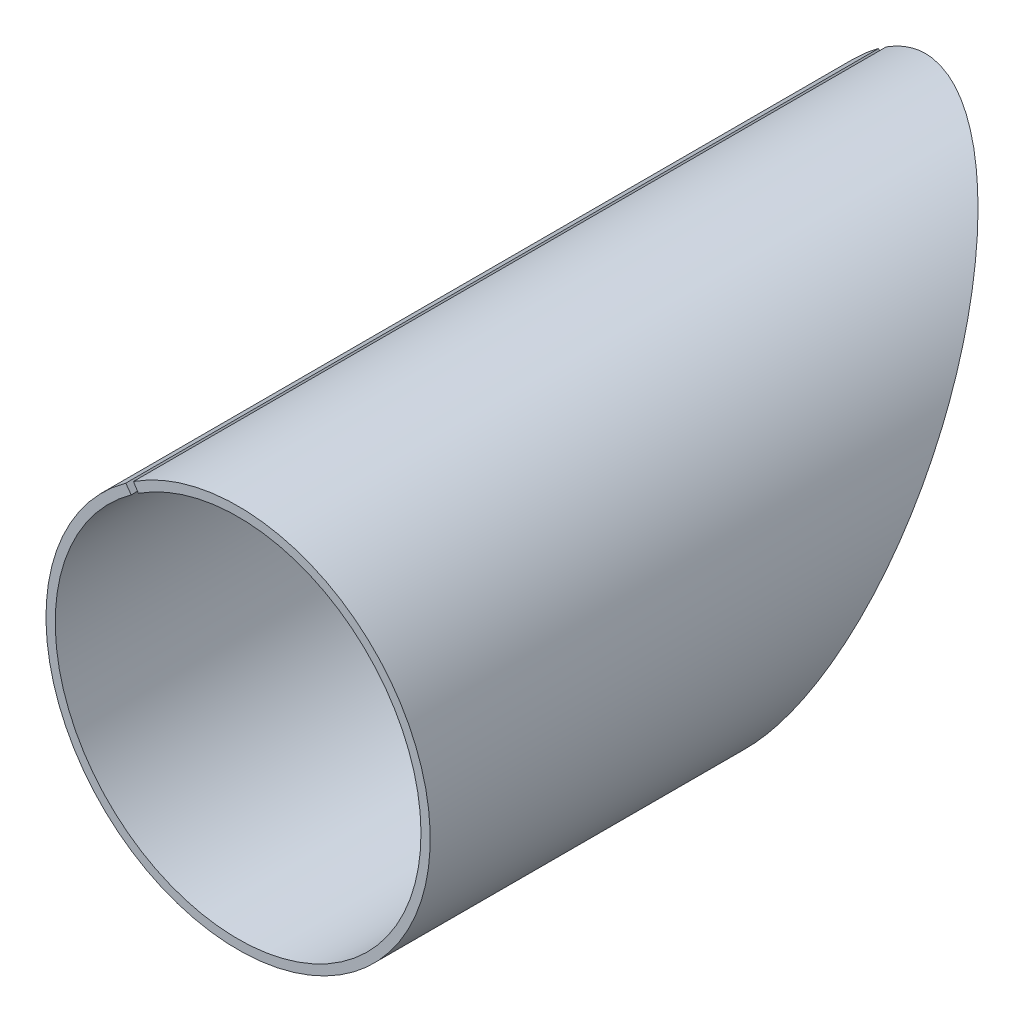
ISO-10303-21;
HEADER;
FILE_DESCRIPTION(('STEP AP214'),'2;1');
FILE_NAME('part.step','',(''),(''),'','','');
FILE_SCHEMA(('AUTOMOTIVE_DESIGN { 1 0 10303 214 1 1 1 1 }'));
ENDSEC;
DATA;
#1=APPLICATION_CONTEXT('core data for automotive mechanical design processes');
#2=APPLICATION_PROTOCOL_DEFINITION('international standard','automotive_design',2000,#1);
#3=PRODUCT_CONTEXT('',#1,'mechanical');
#4=PRODUCT('Part','Part','',(#3));
#5=PRODUCT_RELATED_PRODUCT_CATEGORY('part','',(#4));
#6=PRODUCT_DEFINITION_FORMATION('','',#4);
#7=PRODUCT_DEFINITION_CONTEXT('part definition',#1,'design');
#8=PRODUCT_DEFINITION('design','',#6,#7);
#9=PRODUCT_DEFINITION_SHAPE('','',#8);
#10=(LENGTH_UNIT() NAMED_UNIT(*) SI_UNIT(.MILLI.,.METRE.));
#11=(NAMED_UNIT(*) PLANE_ANGLE_UNIT() SI_UNIT($,.RADIAN.));
#12=(NAMED_UNIT(*) SI_UNIT($,.STERADIAN.) SOLID_ANGLE_UNIT());
#13=UNCERTAINTY_MEASURE_WITH_UNIT(LENGTH_MEASURE(1.E-05),#10,'distance_accuracy_value','');
#14=(GEOMETRIC_REPRESENTATION_CONTEXT(3) GLOBAL_UNCERTAINTY_ASSIGNED_CONTEXT((#13)) GLOBAL_UNIT_ASSIGNED_CONTEXT((#10,
#11,#12)) REPRESENTATION_CONTEXT('',''));
#15=CARTESIAN_POINT('',(0.,0.,0.));
#16=DIRECTION('',(0.,0.,1.));
#17=DIRECTION('',(1.,0.,0.));
#18=AXIS2_PLACEMENT_3D('',#15,#16,#17);
#19=CARTESIAN_POINT('',(-46.4073916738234,66.9188830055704,-20.7800154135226));
#20=CARTESIAN_POINT('',(-46.5737787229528,66.7990247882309,-20.7740218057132));
#21=CARTESIAN_POINT('',(-46.7135948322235,66.6946505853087,-20.767619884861));
#22=CARTESIAN_POINT('',(-46.8854695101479,66.5641428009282,-20.7574040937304));
#23=CARTESIAN_POINT('',(-46.9349732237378,66.5261324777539,-20.7539397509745));
#24=CARTESIAN_POINT('',(-47.0362754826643,66.4476760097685,-20.7463797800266));
#25=CARTESIAN_POINT('',(-47.0865894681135,66.4083342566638,-20.7423266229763));
#26=CARTESIAN_POINT('',(-47.3364797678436,66.211087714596,-20.720694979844));
#27=CARTESIAN_POINT('',(-47.5305308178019,66.0520367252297,-20.6990670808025));
#28=CARTESIAN_POINT('',(-48.1074551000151,65.5614780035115,-20.6200549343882));
#29=CARTESIAN_POINT('',(-48.4817075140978,65.2190805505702,-20.548888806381));
#30=CARTESIAN_POINT('',(-49.5684620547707,64.1487055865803,-20.2793474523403));
#31=CARTESIAN_POINT('',(-50.24446981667,63.3783704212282,-20.0255767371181));
#32=CARTESIAN_POINT('',(-51.487293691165,61.7270610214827,-19.3646696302));
#33=CARTESIAN_POINT('',(-52.0534650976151,60.8464119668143,-18.9578202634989));
#34=CARTESIAN_POINT('',(-53.0544782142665,58.9899002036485,-17.9913299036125));
#35=CARTESIAN_POINT('',(-53.4920643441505,58.0092188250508,-17.4291105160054));
#36=CARTESIAN_POINT('',(-54.0368913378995,56.4682268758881,-16.4652710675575));
#37=CARTESIAN_POINT('',(-54.199627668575,55.9438421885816,-16.1244145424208));
#38=CARTESIAN_POINT('',(-54.4854876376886,54.871603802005,-15.4008338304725));
#39=CARTESIAN_POINT('',(-54.6087818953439,54.3228595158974,-15.017607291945));
#40=CARTESIAN_POINT('',(-54.8119129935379,53.2029721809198,-14.2082818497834));
#41=CARTESIAN_POINT('',(-54.8917473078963,52.6318283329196,-13.7821829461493));
#42=CARTESIAN_POINT('',(-54.9758536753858,51.7609061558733,-13.1108803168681));
#43=CARTESIAN_POINT('',(-54.997979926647,51.4682052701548,-12.8817300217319));
#44=CARTESIAN_POINT('',(-55.0299583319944,50.8746588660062,-12.409831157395));
#45=CARTESIAN_POINT('',(-55.0397570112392,50.5742986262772,-12.1674423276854));
#46=CARTESIAN_POINT('',(-55.0492882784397,49.6632630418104,-11.4209576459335));
#47=CARTESIAN_POINT('',(-55.0291494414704,49.0425936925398,-10.897543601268));
#48=CARTESIAN_POINT('',(-54.9541033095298,48.0955277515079,-10.073786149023));
#49=CARTESIAN_POINT('',(-54.9217461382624,47.7777809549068,-9.7933153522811));
#50=CARTESIAN_POINT('',(-54.8399029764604,47.1286076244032,-9.21126409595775));
#51=CARTESIAN_POINT('',(-54.7904700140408,46.798245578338,-8.91063581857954));
#52=CARTESIAN_POINT('',(-54.6727563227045,46.1270300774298,-8.29017396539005));
#53=CARTESIAN_POINT('',(-54.6044749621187,45.7861761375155,-7.9703403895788));
#54=CARTESIAN_POINT('',(-54.4865440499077,45.267970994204,-7.47618605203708));
#55=CARTESIAN_POINT('',(-54.4446489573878,45.0940835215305,-7.309067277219));
#56=CARTESIAN_POINT('',(-54.3554616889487,44.7441811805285,-6.97002840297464));
#57=CARTESIAN_POINT('',(-54.3082996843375,44.5686231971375,-6.79856635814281));
#58=CARTESIAN_POINT('',(-54.0570050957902,43.6809816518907,-5.92422905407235));
#59=CARTESIAN_POINT('',(-53.7994601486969,42.9145544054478,-5.14588858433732));
#60=CARTESIAN_POINT('',(-53.380631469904,41.9024881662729,-4.07437471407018));
#61=CARTESIAN_POINT('',(-53.292014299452,41.6974054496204,-3.85514252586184));
#62=CARTESIAN_POINT('',(-53.1513054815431,41.3861858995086,-3.51890012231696));
#63=CARTESIAN_POINT('',(-53.1031053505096,41.2818472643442,-3.40558696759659));
#64=CARTESIAN_POINT('',(-53.0040264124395,41.0720462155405,-3.17649595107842));
#65=CARTESIAN_POINT('',(-52.9497282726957,40.9592932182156,-3.05269824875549));
#66=CARTESIAN_POINT('',(-52.6467869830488,40.3468896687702,-2.37561595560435));
#67=CARTESIAN_POINT('',(-52.3104117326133,39.7108707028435,-1.66038910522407));
#68=CARTESIAN_POINT('',(-51.7165774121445,38.770080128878,-0.549404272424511));
#69=CARTESIAN_POINT('',(-51.5890641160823,38.574744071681,-0.316359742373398));
#70=CARTESIAN_POINT('',(-51.4176966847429,38.322482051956,-0.0114946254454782));
#71=CARTESIAN_POINT('',(-51.3828242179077,38.2716256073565,0.0501563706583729));
#72=CARTESIAN_POINT('',(-51.3118545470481,38.1691289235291,0.174814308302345));
#73=CARTESIAN_POINT('',(-51.2757741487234,38.1175218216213,0.237783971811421));
#74=CARTESIAN_POINT('',(-51.1686348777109,37.9657277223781,0.423534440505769));
#75=CARTESIAN_POINT('',(-51.0977118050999,37.8671637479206,0.544885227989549));
#76=CARTESIAN_POINT('',(-50.746187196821,37.3872055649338,1.1392248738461));
#77=CARTESIAN_POINT('',(-50.4749815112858,37.0443948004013,1.57497085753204));
#78=CARTESIAN_POINT('',(-49.9653018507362,36.4333553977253,2.36701135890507));
#79=CARTESIAN_POINT('',(-49.7268156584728,36.1651042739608,2.72330587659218));
#80=CARTESIAN_POINT('',(-49.4009260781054,35.813166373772,3.19815905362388));
#81=CARTESIAN_POINT('',(-49.2975808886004,35.7042658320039,3.34651201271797));
#82=CARTESIAN_POINT('',(-49.1512176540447,35.5529174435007,3.5541443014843));
#83=CARTESIAN_POINT('',(-49.1043648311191,35.5049662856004,3.620175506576));
#84=CARTESIAN_POINT('',(-49.0106512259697,35.4099444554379,3.75150649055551));
#85=CARTESIAN_POINT('',(-48.963802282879,35.3628991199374,3.8167799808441));
#86=CARTESIAN_POINT('',(-48.1676571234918,34.5709637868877,4.91976528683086));
#87=CARTESIAN_POINT('',(-47.4235921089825,33.9438728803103,5.85751666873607));
#88=CARTESIAN_POINT('',(-46.538683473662,33.2813539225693,6.90426535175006));
#89=CARTESIAN_POINT('',(-46.3646207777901,33.1553780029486,7.10652674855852));
#90=CARTESIAN_POINT('',(-46.0151652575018,32.9103966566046,7.50601940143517));
#91=CARTESIAN_POINT('',(-45.8403468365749,32.7918551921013,7.70254668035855));
#92=CARTESIAN_POINT('',(-45.3162007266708,32.4477461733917,8.28247137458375));
#93=CARTESIAN_POINT('',(-44.9671927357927,32.2336985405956,8.6562116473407));
#94=CARTESIAN_POINT('',(-44.2728656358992,31.8344219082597,9.37793981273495));
#95=CARTESIAN_POINT('',(-43.9275461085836,31.6491913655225,9.72592770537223));
#96=CARTESIAN_POINT('',(-43.4142162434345,31.3914382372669,10.2285952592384));
#97=CARTESIAN_POINT('',(-43.2441141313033,31.3089706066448,10.3927047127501));
#98=CARTESIAN_POINT('',(-42.9033158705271,31.1493676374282,10.7168435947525));
#99=CARTESIAN_POINT('',(-42.7328598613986,31.0723607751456,10.876631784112));
#100=CARTESIAN_POINT('',(-41.8807948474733,30.70102174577,11.6641664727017));
#101=CARTESIAN_POINT('',(-41.1999146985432,30.4478189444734,12.2576941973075));
#102=CARTESIAN_POINT('',(-40.1883330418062,30.1279140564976,13.0932357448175));
#103=CARTESIAN_POINT('',(-39.8533924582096,30.0314153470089,13.3621252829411));
#104=CARTESIAN_POINT('',(-39.1845278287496,29.8564290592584,13.8843014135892));
#105=CARTESIAN_POINT('',(-38.8502749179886,29.7778979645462,14.1378325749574));
#106=CARTESIAN_POINT('',(-37.8495334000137,29.5684218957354,14.8757553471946));
#107=CARTESIAN_POINT('',(-37.1850938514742,29.4636127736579,15.3374762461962));
#108=CARTESIAN_POINT('',(-35.8687870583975,29.3190676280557,16.2004628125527));
#109=CARTESIAN_POINT('',(-35.2171682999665,29.2791847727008,16.6015972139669));
#110=CARTESIAN_POINT('',(-33.9222876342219,29.259765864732,17.3489073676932));
#111=CARTESIAN_POINT('',(-33.2802937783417,29.280415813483,17.6944012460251));
#112=CARTESIAN_POINT('',(-32.0125956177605,29.3790006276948,18.3290666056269));
#113=CARTESIAN_POINT('',(-31.387676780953,29.4567685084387,18.6179037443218));
#114=CARTESIAN_POINT('',(-30.1538001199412,29.6667541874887,19.1414227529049));
#115=CARTESIAN_POINT('',(-29.5450144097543,29.7990456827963,19.3760358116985));
#116=CARTESIAN_POINT('',(-28.3482618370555,30.1153496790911,19.7909690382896));
#117=CARTESIAN_POINT('',(-27.7602955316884,30.2993603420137,19.9712892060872));
#118=CARTESIAN_POINT('',(-26.6092707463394,30.7159002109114,20.2776366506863));
#119=CARTESIAN_POINT('',(-26.0452595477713,30.9487152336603,20.4039284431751));
#120=CARTESIAN_POINT('',(-24.3886493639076,31.7191115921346,20.7036640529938));
#121=CARTESIAN_POINT('',(-23.3345531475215,32.3274742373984,20.7973649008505));
#122=CARTESIAN_POINT('',(-21.3518039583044,33.7145067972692,20.772512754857));
#123=CARTESIAN_POINT('',(-20.417300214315,34.4974876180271,20.6539503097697));
#124=CARTESIAN_POINT('',(-19.1246192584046,35.7909756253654,20.3169020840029));
#125=CARTESIAN_POINT('',(-18.7123315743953,36.2413411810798,20.1782178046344));
#126=CARTESIAN_POINT('',(-17.924542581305,37.1825630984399,19.8463988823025));
#127=CARTESIAN_POINT('',(-17.5492806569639,37.6732856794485,19.6533352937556));
#128=CARTESIAN_POINT('',(-16.4860475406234,39.2016316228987,18.9926821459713));
#129=CARTESIAN_POINT('',(-15.8616406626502,40.2929290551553,18.4448252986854));
#130=CARTESIAN_POINT('',(-15.0693299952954,42.0369293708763,17.4532144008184));
#131=CARTESIAN_POINT('',(-14.8296112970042,42.635766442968,17.0945395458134));
#132=CARTESIAN_POINT('',(-14.4040274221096,43.8644790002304,16.3209140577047));
#133=CARTESIAN_POINT('',(-14.2181435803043,44.493887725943,15.9061959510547));
#134=CARTESIAN_POINT('',(-13.9032069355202,45.7889193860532,15.0152797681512));
#135=CARTESIAN_POINT('',(-13.7746117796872,46.4534113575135,14.5397132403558));
#136=CARTESIAN_POINT('',(-13.58191427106,47.8110920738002,13.5283633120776));
#137=CARTESIAN_POINT('',(-13.5176702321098,48.5037397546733,12.9929343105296));
#138=CARTESIAN_POINT('',(-13.4746273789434,49.5684969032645,12.1386228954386));
#139=CARTESIAN_POINT('',(-13.4692210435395,49.9266346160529,11.8461502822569));
#140=CARTESIAN_POINT('',(-13.4775001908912,50.6533096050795,11.2417377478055));
#141=CARTESIAN_POINT('',(-13.4912348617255,51.0224988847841,10.9292605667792));
#142=CARTESIAN_POINT('',(-13.539756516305,51.7714601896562,10.2837643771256));
#143=CARTESIAN_POINT('',(-13.5745441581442,52.151232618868,9.95074536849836));
#144=CARTESIAN_POINT('',(-13.6670232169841,52.9200310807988,9.26416552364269));
#145=CARTESIAN_POINT('',(-13.7243801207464,53.307438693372,8.91211247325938));
#146=CARTESIAN_POINT('',(-13.9367962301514,54.4979390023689,7.8095975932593));
#147=CARTESIAN_POINT('',(-14.1323584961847,55.3273102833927,7.0148114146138));
#148=CARTESIAN_POINT('',(-14.4621666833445,56.3960711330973,5.94660836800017));
#149=CARTESIAN_POINT('',(-14.5330366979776,56.6135667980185,5.72706280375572));
#150=CARTESIAN_POINT('',(-14.6869467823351,57.0593722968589,5.27216967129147));
#151=CARTESIAN_POINT('',(-14.7697966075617,57.2870605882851,5.03744840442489));
#152=CARTESIAN_POINT('',(-15.0377827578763,57.9833697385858,4.31146050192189));
#153=CARTESIAN_POINT('',(-15.2423518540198,58.4652978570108,3.79836976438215));
#154=CARTESIAN_POINT('',(-15.5070163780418,59.0232742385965,3.18840653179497));
#155=CARTESIAN_POINT('',(-15.5366093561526,59.0848986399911,3.12083460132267));
#156=CARTESIAN_POINT('',(-15.5993526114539,59.2138180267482,2.97896455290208));
#157=CARTESIAN_POINT('',(-15.6322826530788,59.2806336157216,2.90519099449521));
#158=CARTESIAN_POINT('',(-15.7359852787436,59.4880166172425,2.67535471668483));
#159=CARTESIAN_POINT('',(-15.8116655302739,59.6355255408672,2.51077639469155));
#160=CARTESIAN_POINT('',(-16.0604207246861,60.1045820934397,1.98297901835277));
#161=CARTESIAN_POINT('',(-16.2551466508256,60.4527625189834,1.58569755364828));
#162=CARTESIAN_POINT('',(-16.6001689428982,61.0216576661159,0.921650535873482));
#163=CARTESIAN_POINT('',(-16.7240154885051,61.2190355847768,0.688947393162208));
#164=CARTESIAN_POINT('',(-16.8909799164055,61.4745488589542,0.383875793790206));
#165=CARTESIAN_POINT('',(-16.9249808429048,61.5260904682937,0.322151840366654));
#166=CARTESIAN_POINT('',(-16.9942273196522,61.6300268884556,0.19728466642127));
#167=CARTESIAN_POINT('',(-17.0296390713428,61.6826598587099,0.133847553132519));
#168=CARTESIAN_POINT('',(-17.13477217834,61.8374051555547,-0.0532004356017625));
#169=CARTESIAN_POINT('',(-17.204249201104,61.9376717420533,-0.175131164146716));
#170=CARTESIAN_POINT('',(-17.5479271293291,62.4248540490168,-0.770945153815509));
#171=CARTESIAN_POINT('',(-17.8108565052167,62.7693270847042,-1.20330945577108));
#172=CARTESIAN_POINT('',(-18.2985414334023,63.3762665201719,-1.97946428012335));
#173=CARTESIAN_POINT('',(-18.5233122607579,63.6387604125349,-2.32325480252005));
#174=CARTESIAN_POINT('',(-18.8239353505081,63.97689439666,-2.77251025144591));
#175=CARTESIAN_POINT('',(-18.9180806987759,64.0803295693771,-2.91119034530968));
#176=CARTESIAN_POINT('',(-19.0494393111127,64.2222052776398,-3.10260290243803));
#177=CARTESIAN_POINT('',(-19.0915837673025,64.2672835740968,-3.16363915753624));
#178=CARTESIAN_POINT('',(-19.172478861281,64.35310931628,-3.28017580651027));
#179=CARTESIAN_POINT('',(-19.2112847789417,64.3939278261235,-3.33576542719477));
#180=CARTESIAN_POINT('',(-19.5655139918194,64.7635649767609,-3.8407960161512));
#181=CARTESIAN_POINT('',(-19.8796440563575,65.069781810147,-4.27072997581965));
#182=CARTESIAN_POINT('',(-20.5007554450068,65.6407939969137,-5.09263365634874));
#183=CARTESIAN_POINT('',(-20.8077384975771,65.9055943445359,-5.48460337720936));
#184=CARTESIAN_POINT('',(-21.2592048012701,66.2743592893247,-6.04408477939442));
#185=CARTESIAN_POINT('',(-21.408198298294,66.3925429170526,-6.22583305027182));
#186=CARTESIAN_POINT('',(-21.7026572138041,66.619880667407,-6.57983853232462));
#187=CARTESIAN_POINT('',(-21.8475395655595,66.7286268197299,-6.75141504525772));
#188=CARTESIAN_POINT('',(-22.5745971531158,67.2600038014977,-7.60051327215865));
#189=CARTESIAN_POINT('',(-23.1577232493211,67.6398220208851,-8.24314422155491));
#190=CARTESIAN_POINT('',(-24.023959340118,68.148325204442,-9.1521191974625));
#191=CARTESIAN_POINT('',(-24.3113178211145,68.3076331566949,-9.44594894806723));
#192=CARTESIAN_POINT('',(-24.8817387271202,68.6070828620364,-10.0152846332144));
#193=CARTESIAN_POINT('',(-25.1649611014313,68.7473726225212,-10.2909749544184));
#194=CARTESIAN_POINT('',(-26.0171181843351,69.1460889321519,-11.1011794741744));
#195=CARTESIAN_POINT('',(-26.5850360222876,69.3804658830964,-11.6153135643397));
#196=CARTESIAN_POINT('',(-27.4312442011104,69.6884421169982,-12.3475113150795));
#197=CARTESIAN_POINT('',(-27.7123776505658,69.783840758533,-12.585076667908));
#198=CARTESIAN_POINT('',(-28.2719791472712,69.9607600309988,-13.0472062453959));
#199=CARTESIAN_POINT('',(-28.5501833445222,70.0422299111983,-13.2715612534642));
#200=CARTESIAN_POINT('',(-29.3854302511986,70.2682483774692,-13.9297250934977));
#201=CARTESIAN_POINT('',(-29.9413758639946,70.3938015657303,-14.3472170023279));
#202=CARTESIAN_POINT('',(-31.0469383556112,70.5973592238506,-15.1396328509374));
#203=CARTESIAN_POINT('',(-31.5965552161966,70.6753663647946,-15.5145567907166));
#204=CARTESIAN_POINT('',(-32.6854390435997,70.786848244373,-16.2218367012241));
#205=CARTESIAN_POINT('',(-33.2266598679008,70.820563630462,-16.5553389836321));
#206=CARTESIAN_POINT('',(-34.3023087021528,70.8461117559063,-17.1838892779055));
#207=CARTESIAN_POINT('',(-34.8362477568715,70.8378936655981,-17.4786496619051));
#208=CARTESIAN_POINT('',(-35.8932208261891,70.7815382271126,-18.0291409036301));
#209=CARTESIAN_POINT('',(-36.4157523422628,70.7334731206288,-18.2846353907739));
#210=CARTESIAN_POINT('',(-37.966453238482,70.5322663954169,-18.9943110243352));
#211=CARTESIAN_POINT('',(-38.9797509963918,70.3215789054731,-19.3926855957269));
#212=CARTESIAN_POINT('',(-40.9447934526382,69.7607901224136,-20.039949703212));
#213=CARTESIAN_POINT('',(-41.8961013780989,69.4111384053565,-20.288602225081));
#214=CARTESIAN_POINT('',(-43.2712968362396,68.7901171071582,-20.5528969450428));
#215=CARTESIAN_POINT('',(-43.7207595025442,68.5671068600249,-20.6227186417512));
#216=CARTESIAN_POINT('',(-44.3800684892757,68.2098775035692,-20.7003491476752));
#217=CARTESIAN_POINT('',(-44.5962644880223,68.087701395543,-20.7216193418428));
#218=CARTESIAN_POINT('',(-44.8690934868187,67.9268536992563,-20.74296695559));
#219=CARTESIAN_POINT('',(-44.9237355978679,67.8943030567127,-20.7469708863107));
#220=CARTESIAN_POINT('',(-45.0331605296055,67.8284300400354,-20.7544475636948));
#221=CARTESIAN_POINT('',(-45.0868619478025,67.7957959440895,-20.757892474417));
#222=CARTESIAN_POINT('',(-45.270174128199,67.6830452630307,-20.7679932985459));
#223=CARTESIAN_POINT('',(-45.4152877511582,67.5921107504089,-20.7742452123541));
#224=CARTESIAN_POINT('',(-45.5821699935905,67.4836919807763,-20.7800154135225));
#225=CARTESIAN_POINT('',(-45.8228957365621,66.1074863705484,-20.7800154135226));
#226=CARTESIAN_POINT('',(-45.9812780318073,65.993394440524,-20.7740218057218));
#227=CARTESIAN_POINT('',(-46.1143676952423,65.8940416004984,-20.767619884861));
#228=CARTESIAN_POINT('',(-46.2779736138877,65.7698124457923,-20.7574040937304));
#229=CARTESIAN_POINT('',(-46.3250957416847,65.7336307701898,-20.7539397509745));
#230=CARTESIAN_POINT('',(-46.4215244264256,65.6589487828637,-20.7463797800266));
#231=CARTESIAN_POINT('',(-46.4694178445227,65.6214997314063,-20.7423266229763));
#232=CARTESIAN_POINT('',(-46.7072861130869,65.4337425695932,-20.720694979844));
#233=CARTESIAN_POINT('',(-46.8920015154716,65.2823434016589,-20.6990670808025));
#234=CARTESIAN_POINT('',(-47.441170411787,64.8153850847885,-20.6200549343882));
#235=CARTESIAN_POINT('',(-47.7974178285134,64.4894601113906,-20.548888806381));
#236=CARTESIAN_POINT('',(-48.8318894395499,63.4705800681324,-20.2793474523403));
#237=CARTESIAN_POINT('',(-49.4753749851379,62.7373051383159,-20.0255767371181));
#238=CARTESIAN_POINT('',(-50.6584075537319,61.1654389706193,-19.3646696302));
#239=CARTESIAN_POINT('',(-51.1973408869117,60.3271572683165,-18.9578202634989));
#240=CARTESIAN_POINT('',(-52.1501960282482,58.5599608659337,-17.9913299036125));
#241=CARTESIAN_POINT('',(-52.566730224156,57.626459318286,-17.4291105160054));
#242=CARTESIAN_POINT('',(-53.0853460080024,56.1596033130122,-16.4652710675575));
#243=CARTESIAN_POINT('',(-53.2402532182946,55.6604463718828,-16.1244145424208));
#244=CARTESIAN_POINT('',(-53.5123606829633,54.6397925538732,-15.4008338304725));
#245=CARTESIAN_POINT('',(-53.6297233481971,54.117447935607,-15.017607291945));
#246=CARTESIAN_POINT('',(-53.8230819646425,53.0514375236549,-14.2082818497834));
#247=CARTESIAN_POINT('',(-53.8990755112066,52.5077709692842,-13.7821829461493));
#248=CARTESIAN_POINT('',(-53.9791355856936,51.6787481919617,-13.1108803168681));
#249=CARTESIAN_POINT('',(-54.0001973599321,51.400128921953,-12.8817300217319));
#250=CARTESIAN_POINT('',(-54.0306373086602,50.8351375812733,-12.409831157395));
#251=CARTESIAN_POINT('',(-54.0399645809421,50.5492274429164,-12.1674423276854));
#252=CARTESIAN_POINT('',(-54.0490373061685,49.6820210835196,-11.4209576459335));
#253=CARTESIAN_POINT('',(-54.0298673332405,49.09121166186,-10.897543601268));
#254=CARTESIAN_POINT('',(-53.9584316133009,48.1897083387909,-10.073786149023));
#255=CARTESIAN_POINT('',(-53.9276311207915,47.8872480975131,-9.7933153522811));
#256=CARTESIAN_POINT('',(-53.8497253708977,47.2693059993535,-9.21126409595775));
#257=CARTESIAN_POINT('',(-53.8026705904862,46.9548374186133,-8.91063581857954));
#258=CARTESIAN_POINT('',(-53.6906200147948,46.315913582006,-8.29017396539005));
#259=CARTESIAN_POINT('',(-53.6256236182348,45.991457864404,-7.9703403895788));
#260=CARTESIAN_POINT('',(-53.5133662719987,45.498183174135,-7.47618605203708));
#261=CARTESIAN_POINT('',(-53.4734867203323,45.3326612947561,-7.309067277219));
#262=CARTESIAN_POINT('',(-53.3885901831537,44.9995924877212,-6.97002840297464));
#263=CARTESIAN_POINT('',(-53.3436971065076,44.8324804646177,-6.79856635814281));
#264=CARTESIAN_POINT('',(-53.104492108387,43.9875426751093,-5.92422905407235));
#265=CARTESIAN_POINT('',(-52.8593374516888,43.2579876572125,-5.14588858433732));
#266=CARTESIAN_POINT('',(-52.4606583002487,42.294611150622,-4.07437471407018));
#267=CARTESIAN_POINT('',(-52.3763044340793,42.0993948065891,-3.85514252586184));
#268=CARTESIAN_POINT('',(-52.2423650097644,41.8031477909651,-3.51890012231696));
#269=CARTESIAN_POINT('',(-52.1964837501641,41.7038288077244,-3.40558696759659));
#270=CARTESIAN_POINT('',(-52.1021714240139,41.5041211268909,-3.17649595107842));
#271=CARTESIAN_POINT('',(-52.0504855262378,41.3967925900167,-3.05269824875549));
#272=CARTESIAN_POINT('',(-51.7621185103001,40.8138513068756,-2.37561595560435));
#273=CARTESIAN_POINT('',(-51.441926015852,40.2084307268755,-1.66038910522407));
#274=CARTESIAN_POINT('',(-50.8766606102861,39.3129008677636,-0.549404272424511));
#275=CARTESIAN_POINT('',(-50.7552818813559,39.1269622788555,-0.316359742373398));
#276=CARTESIAN_POINT('',(-50.5921588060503,38.8868363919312,-0.0114946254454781));
#277=CARTESIAN_POINT('',(-50.5589640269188,38.8384266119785,0.0501563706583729));
#278=CARTESIAN_POINT('',(-50.4914086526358,38.740860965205,0.174814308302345));
#279=CARTESIAN_POINT('',(-50.4570640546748,38.691736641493,0.237783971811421));
#280=CARTESIAN_POINT('',(-50.3550791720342,38.5472452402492,0.423534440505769));
#281=CARTESIAN_POINT('',(-50.2875681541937,38.4534231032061,0.544885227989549));
#282=CARTESIAN_POINT('',(-49.9529551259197,37.9965553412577,1.1392248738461));
#283=CARTESIAN_POINT('',(-49.6947969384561,37.670236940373,1.57497085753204));
#284=CARTESIAN_POINT('',(-49.2096375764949,37.0885941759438,2.36701135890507));
#285=CARTESIAN_POINT('',(-48.9826247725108,36.8332484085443,2.72330587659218));
#286=CARTESIAN_POINT('',(-48.6724134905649,36.4982419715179,3.19815905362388));
#287=CARTESIAN_POINT('',(-48.5740401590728,36.3945805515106,3.34651201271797));
#288=CARTESIAN_POINT('',(-48.4347183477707,36.2505134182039,3.5541443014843));
#289=CARTESIAN_POINT('',(-48.3901195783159,36.2048691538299,3.620175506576));
#290=CARTESIAN_POINT('',(-48.3009144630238,36.1144187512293,3.75150649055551));
#291=CARTESIAN_POINT('',(-48.256319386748,36.0696367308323,3.8167799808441));
#292=CARTESIAN_POINT('',(-47.4984761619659,35.3158008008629,4.91976528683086));
#293=CARTESIAN_POINT('',(-46.7902075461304,34.7188787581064,5.85751666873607));
#294=CARTESIAN_POINT('',(-45.9478711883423,34.0882330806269,6.90426535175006));
#295=CARTESIAN_POINT('',(-45.7821825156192,33.9683177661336,7.10652674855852));
#296=CARTESIAN_POINT('',(-45.4495390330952,33.7351222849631,7.50601940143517));
#297=CARTESIAN_POINT('',(-45.2831309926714,33.6222837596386,7.70254668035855));
#298=CARTESIAN_POINT('',(-44.784201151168,33.2947295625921,8.28247137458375));
#299=CARTESIAN_POINT('',(-44.4519836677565,33.0909795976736,8.6562116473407));
#300=CARTESIAN_POINT('',(-43.7910601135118,32.7109118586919,9.37793981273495));
#301=CARTESIAN_POINT('',(-43.4623536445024,32.5345926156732,9.72592770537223));
#302=CARTESIAN_POINT('',(-42.9737196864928,32.2892397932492,10.2285952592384));
#303=CARTESIAN_POINT('',(-42.8118010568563,32.2107396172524,10.3927047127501));
#304=CARTESIAN_POINT('',(-42.4873983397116,32.0588150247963,10.7168435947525));
#305=CARTESIAN_POINT('',(-42.3251428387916,31.9855129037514,10.876631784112));
#306=CARTESIAN_POINT('',(-41.5140700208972,31.6320387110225,11.6641664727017));
#307=CARTESIAN_POINT('',(-40.8659464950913,31.3910173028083,12.2576941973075));
#308=CARTESIAN_POINT('',(-39.9030312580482,31.086502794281,13.0932357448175));
#309=CARTESIAN_POINT('',(-39.5842044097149,30.9946465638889,13.3621252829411));
#310=CARTESIAN_POINT('',(-38.9475183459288,30.8280787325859,13.8843014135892));
#311=CARTESIAN_POINT('',(-38.629346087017,30.7533257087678,14.1378325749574));
#312=CARTESIAN_POINT('',(-37.6767494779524,30.5539273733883,14.8757553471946));
#313=CARTESIAN_POINT('',(-37.0442756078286,30.4541605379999,15.3374762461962));
#314=CARTESIAN_POINT('',(-35.7912953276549,30.3165693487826,16.2004628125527));
#315=CARTESIAN_POINT('',(-35.1710254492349,30.2786052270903,16.6015972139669));
#316=CARTESIAN_POINT('',(-33.9384405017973,30.2601205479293,17.3489073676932));
#317=CARTESIAN_POINT('',(-33.3273324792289,30.2797770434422,17.6944012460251));
#318=CARTESIAN_POINT('',(-32.1206223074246,30.3736190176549,18.3290666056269));
#319=CARTESIAN_POINT('',(-31.5257678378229,30.4476455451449,18.6179037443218));
#320=CARTESIAN_POINT('',(-30.3512520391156,30.6475289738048,19.1414227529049));
#321=CARTESIAN_POINT('',(-29.7717545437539,30.7734560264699,19.3760358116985));
#322=CARTESIAN_POINT('',(-28.632576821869,31.0745428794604,19.7909690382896));
#323=CARTESIAN_POINT('',(-28.072897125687,31.2497009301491,19.9712892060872));
#324=CARTESIAN_POINT('',(-26.9772472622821,31.6462013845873,20.2776366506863));
#325=CARTESIAN_POINT('',(-26.4403702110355,31.8678158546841,20.4039284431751));
#326=CARTESIAN_POINT('',(-24.8634582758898,32.6011490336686,20.7036640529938));
#327=CARTESIAN_POINT('',(-23.8600738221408,33.1802438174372,20.7973649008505));
#328=CARTESIAN_POINT('',(-21.9727131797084,34.5005473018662,20.772512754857));
#329=CARTESIAN_POINT('',(-21.0831676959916,35.2458595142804,20.6539503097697));
#330=CARTESIAN_POINT('',(-19.8526766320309,36.4771188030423,20.3169020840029));
#331=CARTESIAN_POINT('',(-19.4602237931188,36.9058176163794,20.1782178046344));
#332=CARTESIAN_POINT('',(-18.7103347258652,37.8017580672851,19.8463988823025));
#333=CARTESIAN_POINT('',(-18.3531263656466,38.2688723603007,19.6533352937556));
#334=CARTESIAN_POINT('',(-17.3410445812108,39.7236907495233,18.9926821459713));
#335=CARTESIAN_POINT('',(-16.7466774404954,40.7624866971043,18.4448252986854));
#336=CARTESIAN_POINT('',(-15.9924842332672,42.422584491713,17.4532144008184));
#337=CARTESIAN_POINT('',(-15.7642982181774,42.9926119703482,17.0945395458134));
#338=CARTESIAN_POINT('',(-15.3591888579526,44.1622121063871,16.3209140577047));
#339=CARTESIAN_POINT('',(-15.1822477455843,44.7613404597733,15.9061959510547));
#340=CARTESIAN_POINT('',(-14.8824624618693,45.994069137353,15.0152797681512));
#341=CARTESIAN_POINT('',(-14.7600539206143,46.6265929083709,14.5397132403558));
#342=CARTESIAN_POINT('',(-14.5766269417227,47.918956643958,13.5283633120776));
#343=CARTESIAN_POINT('',(-14.5154736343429,48.5782815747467,12.9929343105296));
#344=CARTESIAN_POINT('',(-14.4745015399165,49.5918140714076,12.1386228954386));
#345=CARTESIAN_POINT('',(-14.4693552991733,49.932722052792,11.8461502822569));
#346=CARTESIAN_POINT('',(-14.477236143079,50.6244372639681,11.2417377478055));
#347=CARTESIAN_POINT('',(-14.4903100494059,50.9758651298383,10.9292605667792));
#348=CARTESIAN_POINT('',(-14.5364973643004,51.6887944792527,10.2837643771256));
#349=CARTESIAN_POINT('',(-14.5696113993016,52.0502963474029,9.95074536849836));
#350=CARTESIAN_POINT('',(-14.6576413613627,52.7821085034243,9.26416552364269));
#351=CARTESIAN_POINT('',(-14.7122388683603,53.1508782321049,8.91211247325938));
#352=CARTESIAN_POINT('',(-14.91443580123,54.2841044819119,7.8095975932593));
#353=CARTESIAN_POINT('',(-15.1005897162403,55.073575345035,7.0148114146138));
#354=CARTESIAN_POINT('',(-15.4145310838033,56.0909189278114,5.94660836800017));
#355=CARTESIAN_POINT('',(-15.4819915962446,56.297951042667,5.72706280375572));
#356=CARTESIAN_POINT('',(-15.6284971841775,56.7223091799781,5.27216967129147));
#357=CARTESIAN_POINT('',(-15.7073611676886,56.9390435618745,5.03744840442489));
#358=CARTESIAN_POINT('',(-15.9624547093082,57.6018538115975,4.31146050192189));
#359=CARTESIAN_POINT('',(-16.1571821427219,58.060596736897,3.79836976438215));
#360=CARTESIAN_POINT('',(-16.4091138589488,58.59172930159,3.18840653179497));
#361=CARTESIAN_POINT('',(-16.4372831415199,58.6503890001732,3.12083460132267));
#362=CARTESIAN_POINT('',(-16.4970078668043,58.7731061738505,2.97896455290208));
#363=CARTESIAN_POINT('',(-16.5283536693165,58.8367073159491,2.90519099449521));
#364=CARTESIAN_POINT('',(-16.6270672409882,59.0341132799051,2.67535471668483));
#365=CARTESIAN_POINT('',(-16.6991065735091,59.1745256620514,2.51077639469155));
#366=CARTESIAN_POINT('',(-16.935894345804,59.6210162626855,1.98297901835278));
#367=CARTESIAN_POINT('',(-17.1212521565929,59.9524459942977,1.58569755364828));
#368=CARTESIAN_POINT('',(-17.4496756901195,60.4939720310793,0.921650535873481));
#369=CARTESIAN_POINT('',(-17.5675640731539,60.6818542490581,0.688947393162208));
#370=CARTESIAN_POINT('',(-17.7264959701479,60.9250749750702,0.383875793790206));
#371=CARTESIAN_POINT('',(-17.7588611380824,60.9741369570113,0.322151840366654));
#372=CARTESIAN_POINT('',(-17.8247762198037,61.0730730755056,0.19728466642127));
#373=CARTESIAN_POINT('',(-17.8584843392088,61.1231739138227,0.133847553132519));
#374=CARTESIAN_POINT('',(-17.9585595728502,61.2704745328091,-0.0532004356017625));
#375=CARTESIAN_POINT('',(-18.0246941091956,61.3659173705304,-0.175131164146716));
#376=CARTESIAN_POINT('',(-18.3518379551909,61.8296617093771,-0.770945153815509));
#377=CARTESIAN_POINT('',(-18.6021179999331,62.157562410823,-1.20330945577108));
#378=CARTESIAN_POINT('',(-19.0663407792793,62.73530245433,-1.97946428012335));
#379=CARTESIAN_POINT('',(-19.2802980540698,62.9851679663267,-2.32325480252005));
#380=CARTESIAN_POINT('',(-19.5664583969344,63.3070345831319,-2.77251025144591));
#381=CARTESIAN_POINT('',(-19.6560744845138,63.4054935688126,-2.91119034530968));
#382=CARTESIAN_POINT('',(-19.7811135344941,63.5405437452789,-3.10260290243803));
#383=CARTESIAN_POINT('',(-19.8212304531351,63.5834533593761,-3.16363915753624));
#384=CARTESIAN_POINT('',(-19.8982337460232,63.6651500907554,-3.28017580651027));
#385=CARTESIAN_POINT('',(-19.9351727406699,63.7040048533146,-3.33576542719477));
#386=CARTESIAN_POINT('',(-20.2723602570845,64.0558590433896,-3.8407960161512));
#387=CARTESIAN_POINT('',(-20.5713777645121,64.3473440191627,-4.27072997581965));
#388=CARTESIAN_POINT('',(-21.1626079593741,64.8908852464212,-5.09263365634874));
#389=CARTESIAN_POINT('',(-21.4548222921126,65.1429462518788,-5.48460337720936));
#390=CARTESIAN_POINT('',(-21.8845688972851,65.4939701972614,-6.04408477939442));
#391=CARTESIAN_POINT('',(-22.0263944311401,65.6064681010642,-6.22583305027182));
#392=CARTESIAN_POINT('',(-22.306687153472,65.8228688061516,-6.57983853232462));
#393=CARTESIAN_POINT('',(-22.4445993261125,65.9263832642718,-6.75141504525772));
#394=CARTESIAN_POINT('',(-23.1366787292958,66.4321961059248,-7.60051327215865));
#395=CARTESIAN_POINT('',(-23.6917510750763,66.7937415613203,-8.24314422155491));
#396=CARTESIAN_POINT('',(-24.5163132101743,67.277781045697,-9.1521191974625));
#397=CARTESIAN_POINT('',(-24.7898470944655,67.4294248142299,-9.44594894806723));
#398=CARTESIAN_POINT('',(-25.3328254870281,67.7144682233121,-10.0152846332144));
#399=CARTESIAN_POINT('',(-25.6024222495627,67.8480087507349,-10.2909749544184));
#400=CARTESIAN_POINT('',(-26.4135827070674,68.2275431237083,-11.1011794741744));
#401=CARTESIAN_POINT('',(-26.954178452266,68.45064437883,-11.6153135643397));
#402=CARTESIAN_POINT('',(-27.7596762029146,68.743804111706,-12.3475113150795));
#403=CARTESIAN_POINT('',(-28.0272845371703,68.8346131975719,-12.585076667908));
#404=CARTESIAN_POINT('',(-28.5599640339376,69.0030210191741,-13.0472062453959));
#405=CARTESIAN_POINT('',(-28.8247840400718,69.0805714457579,-13.2715612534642));
#406=CARTESIAN_POINT('',(-29.6198478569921,69.2957163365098,-13.9297250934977));
#407=CARTESIAN_POINT('',(-30.1490473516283,69.4152292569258,-14.3472170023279));
#408=CARTESIAN_POINT('',(-31.2014220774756,69.6089939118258,-15.1396328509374));
#409=CARTESIAN_POINT('',(-31.724597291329,69.6832481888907,-15.5145567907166));
#410=CARTESIAN_POINT('',(-32.7610957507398,69.789366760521,-16.2218367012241));
#411=CARTESIAN_POINT('',(-33.2762788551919,69.8214601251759,-16.5553389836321));
#412=CARTESIAN_POINT('',(-34.300179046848,69.8457791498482,-17.1838892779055));
#413=CARTESIAN_POINT('',(-34.8084307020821,69.8379564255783,-17.4786496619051));
#414=CARTESIAN_POINT('',(-35.8145536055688,69.784312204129,-18.0291409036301));
#415=CARTESIAN_POINT('',(-36.3119465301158,69.7385594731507,-18.2846353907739));
#416=CARTESIAN_POINT('',(-37.7880443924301,69.5470326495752,-18.9943110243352));
#417=CARTESIAN_POINT('',(-38.7525931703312,69.3464811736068,-19.3926855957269));
#418=CARTESIAN_POINT('',(-40.6230989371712,68.8126715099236,-20.039949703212));
#419=CARTESIAN_POINT('',(-41.5286401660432,68.4798412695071,-20.288602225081));
#420=CARTESIAN_POINT('',(-42.8376760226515,67.8886968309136,-20.5528969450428));
#421=CARTESIAN_POINT('',(-43.2655153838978,67.6764154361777,-20.6227186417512));
#422=CARTESIAN_POINT('',(-43.8931055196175,67.3363721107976,-20.7003491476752));
#423=CARTESIAN_POINT('',(-44.098900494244,67.2200738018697,-20.7216193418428));
#424=CARTESIAN_POINT('',(-44.3586038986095,67.0669643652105,-20.74296695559));
#425=CARTESIAN_POINT('',(-44.4106172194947,67.0359797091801,-20.7469708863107));
#426=CARTESIAN_POINT('',(-44.5147778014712,66.9732757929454,-20.7544475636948));
#427=CARTESIAN_POINT('',(-44.5658956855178,66.942211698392,-20.757892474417));
#428=CARTESIAN_POINT('',(-44.7403888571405,66.83488536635,-20.7679932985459));
#429=CARTESIAN_POINT('',(-44.8785211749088,66.7483256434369,-20.7742452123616));
#430=CARTESIAN_POINT('',(-45.03737484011,66.6451228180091,-20.7800154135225));
#431=B_SPLINE_SURFACE_WITH_KNOTS('',1,3,((#19,#20,#21,#22,#23,#24,#25,#26,#27,#28,#29,#30,#31,
#32,#33,#34,#35,#36,#37,#38,#39,#40,#41,#42,#43,#44,#45,#46,#47,#48,#49,#50,#51,#52,#53,#54,#55,
#56,#57,#58,#59,#60,#61,#62,#63,#64,#65,#66,#67,#68,#69,#70,#71,#72,#73,#74,#75,#76,#77,#78,#79,
#80,#81,#82,#83,#84,#85,#86,#87,#88,#89,#90,#91,#92,#93,#94,#95,#96,#97,#98,#99,#100,#101,#102,
#103,#104,#105,#106,#107,#108,#109,#110,#111,#112,#113,#114,#115,#116,#117,#118,#119,#120,#121,
#122,#123,#124,#125,#126,#127,#128,#129,#130,#131,#132,#133,#134,#135,#136,#137,#138,#139,#140,
#141,#142,#143,#144,#145,#146,#147,#148,#149,#150,#151,#152,#153,#154,#155,#156,#157,#158,#159,
#160,#161,#162,#163,#164,#165,#166,#167,#168,#169,#170,#171,#172,#173,#174,#175,#176,#177,#178,
#179,#180,#181,#182,#183,#184,#185,#186,#187,#188,#189,#190,#191,#192,#193,#194,#195,#196,#197,
#198,#199,#200,#201,#202,#203,#204,#205,#206,#207,#208,#209,#210,#211,#212,#213,#214,#215,#216,
#217,#218,#219,#220,#221,#222,#223,#224),(#225,#226,#227,#228,#229,#230,#231,#232,#233,#234,
#235,#236,#237,#238,#239,#240,#241,#242,#243,#244,#245,#246,#247,#248,#249,#250,#251,#252,#253,
#254,#255,#256,#257,#258,#259,#260,#261,#262,#263,#264,#265,#266,#267,#268,#269,#270,#271,#272,
#273,#274,#275,#276,#277,#278,#279,#280,#281,#282,#283,#284,#285,#286,#287,#288,#289,#290,#291,
#292,#293,#294,#295,#296,#297,#298,#299,#300,#301,#302,#303,#304,#305,#306,#307,#308,#309,#310,
#311,#312,#313,#314,#315,#316,#317,#318,#319,#320,#321,#322,#323,#324,#325,#326,#327,#328,#329,
#330,#331,#332,#333,#334,#335,#336,#337,#338,#339,#340,#341,#342,#343,#344,#345,#346,#347,#348,
#349,#350,#351,#352,#353,#354,#355,#356,#357,#358,#359,#360,#361,#362,#363,#364,#365,#366,#367,
#368,#369,#370,#371,#372,#373,#374,#375,#376,#377,#378,#379,#380,#381,#382,#383,#384,#385,#386,
#387,#388,#389,#390,#391,#392,#393,#394,#395,#396,#397,#398,#399,#400,#401,#402,#403,#404,#405,
#406,#407,#408,#409,#410,#411,#412,#413,#414,#415,#416,#417,#418,#419,#420,#421,#422,#423,#424,
#425,#426,#427,#428,#429,#430)),.UNSPECIFIED.,.F.,.F.,.F.,(2,2),(4,2,2,2,2,2,2,2,2,2,2,2,2,2,2,
2,2,2,2,2,2,2,2,2,2,2,2,2,2,2,2,2,2,2,2,2,2,2,2,2,2,2,2,2,2,2,2,2,2,2,2,2,2,2,2,2,2,2,2,2,2,2,2,
2,2,2,2,2,2,2,2,2,2,2,2,2,2,2,2,2,2,2,2,2,2,2,2,2,2,2,2,2,2,2,2,2,2,2,2,2,2,2,4),(0.,1.),(0.,
0.00390625,0.005859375,0.0078125,0.015625,0.03125,0.0625,0.09375,0.125,0.140625,0.15625,
0.171875,0.1796875,0.1875,0.203125,0.2109375,0.21875,0.2265625,0.23046875,0.234375,0.25,
0.25390625,0.255859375,0.2578125,0.265625,0.267578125,0.26806640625,0.2685546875,0.26953125,
0.2734375,0.27734375,0.279296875,0.2802734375,0.28125,0.296875,0.30078125,0.3046875,0.3125,
0.3203125,0.32421875,0.328125,0.34375,0.3515625,0.359375,0.375,0.390625,0.40625,0.421875,0.4375,
0.453125,0.46875,0.5,0.53125,0.546875,0.5625,0.59375,0.609375,0.625,0.640625,0.65625,0.6640625,
0.671875,0.6796875,0.6875,0.703125,0.70703125,0.7109375,0.71875,0.7197265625,0.720703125,
0.72265625,0.7265625,0.728515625,0.72900390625,0.7294921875,0.73046875,0.734375,0.73828125,
0.740234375,0.7412109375,0.7421875,0.75,0.7578125,0.76171875,0.765625,0.78125,0.7890625,
0.796875,0.8125,0.8203125,0.828125,0.84375,0.859375,0.875,0.890625,0.90625,0.9375,0.96875,
0.984375,0.9921875,0.994140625,0.99609375,1.),.UNSPECIFIED.);
#432=CARTESIAN_POINT('',(-46.4073916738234,66.9188830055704,-20.7800154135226));
#433=CARTESIAN_POINT('',(-45.8228957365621,66.1074863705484,-20.7800154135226));
#434=B_SPLINE_CURVE_WITH_KNOTS('',1,(#432,#433),.UNSPECIFIED.,.F.,.F.,(2,2),(0.,1.),.UNSPECIFIED.);
#435=CARTESIAN_POINT('',(-45.8228957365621,66.1074863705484,-20.7800154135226));
#436=VERTEX_POINT('',#435);
#437=CARTESIAN_POINT('',(-46.4073916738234,66.9188830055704,-20.7800154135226));
#438=VERTEX_POINT('',#437);
#439=EDGE_CURVE('E13',#436,#438,#434,.F.);
#440=CARTESIAN_POINT('',(-45.8228957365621,66.1074863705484,-20.7800154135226));
#441=CARTESIAN_POINT('',(-45.9812780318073,65.993394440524,-20.7740218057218));
#442=CARTESIAN_POINT('',(-46.1143676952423,65.8940416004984,-20.767619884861));
#443=CARTESIAN_POINT('',(-46.2779736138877,65.7698124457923,-20.7574040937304));
#444=CARTESIAN_POINT('',(-46.3250957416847,65.7336307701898,-20.7539397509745));
#445=CARTESIAN_POINT('',(-46.4215244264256,65.6589487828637,-20.7463797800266));
#446=CARTESIAN_POINT('',(-46.4694178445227,65.6214997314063,-20.7423266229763));
#447=CARTESIAN_POINT('',(-46.7072861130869,65.4337425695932,-20.720694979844));
#448=CARTESIAN_POINT('',(-46.8920015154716,65.2823434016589,-20.6990670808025));
#449=CARTESIAN_POINT('',(-47.441170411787,64.8153850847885,-20.6200549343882));
#450=CARTESIAN_POINT('',(-47.7974178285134,64.4894601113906,-20.548888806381));
#451=CARTESIAN_POINT('',(-48.8318894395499,63.4705800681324,-20.2793474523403));
#452=CARTESIAN_POINT('',(-49.4753749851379,62.7373051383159,-20.0255767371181));
#453=CARTESIAN_POINT('',(-50.6584075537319,61.1654389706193,-19.3646696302));
#454=CARTESIAN_POINT('',(-51.1973408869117,60.3271572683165,-18.9578202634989));
#455=CARTESIAN_POINT('',(-52.1501960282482,58.5599608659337,-17.9913299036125));
#456=CARTESIAN_POINT('',(-52.566730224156,57.626459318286,-17.4291105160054));
#457=CARTESIAN_POINT('',(-53.0853460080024,56.1596033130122,-16.4652710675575));
#458=CARTESIAN_POINT('',(-53.2402532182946,55.6604463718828,-16.1244145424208));
#459=CARTESIAN_POINT('',(-53.5123606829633,54.6397925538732,-15.4008338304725));
#460=CARTESIAN_POINT('',(-53.6297233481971,54.117447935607,-15.017607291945));
#461=CARTESIAN_POINT('',(-53.8230819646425,53.0514375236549,-14.2082818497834));
#462=CARTESIAN_POINT('',(-53.8990755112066,52.5077709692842,-13.7821829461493));
#463=CARTESIAN_POINT('',(-53.9791355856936,51.6787481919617,-13.1108803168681));
#464=CARTESIAN_POINT('',(-54.0001973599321,51.400128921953,-12.8817300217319));
#465=CARTESIAN_POINT('',(-54.0306373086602,50.8351375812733,-12.409831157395));
#466=CARTESIAN_POINT('',(-54.0399645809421,50.5492274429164,-12.1674423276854));
#467=CARTESIAN_POINT('',(-54.0490373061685,49.6820210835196,-11.4209576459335));
#468=CARTESIAN_POINT('',(-54.0298673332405,49.09121166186,-10.897543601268));
#469=CARTESIAN_POINT('',(-53.9584316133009,48.1897083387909,-10.073786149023));
#470=CARTESIAN_POINT('',(-53.9276311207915,47.8872480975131,-9.7933153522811));
#471=CARTESIAN_POINT('',(-53.8497253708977,47.2693059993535,-9.21126409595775));
#472=CARTESIAN_POINT('',(-53.8026705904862,46.9548374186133,-8.91063581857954));
#473=CARTESIAN_POINT('',(-53.6906200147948,46.315913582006,-8.29017396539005));
#474=CARTESIAN_POINT('',(-53.6256236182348,45.991457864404,-7.9703403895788));
#475=CARTESIAN_POINT('',(-53.5133662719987,45.498183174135,-7.47618605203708));
#476=CARTESIAN_POINT('',(-53.4734867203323,45.3326612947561,-7.309067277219));
#477=CARTESIAN_POINT('',(-53.3885901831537,44.9995924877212,-6.97002840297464));
#478=CARTESIAN_POINT('',(-53.3436971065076,44.8324804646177,-6.79856635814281));
#479=CARTESIAN_POINT('',(-53.104492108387,43.9875426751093,-5.92422905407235));
#480=CARTESIAN_POINT('',(-52.8593374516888,43.2579876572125,-5.14588858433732));
#481=CARTESIAN_POINT('',(-52.4606583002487,42.294611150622,-4.07437471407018));
#482=CARTESIAN_POINT('',(-52.3763044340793,42.0993948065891,-3.85514252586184));
#483=CARTESIAN_POINT('',(-52.2423650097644,41.8031477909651,-3.51890012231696));
#484=CARTESIAN_POINT('',(-52.1964837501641,41.7038288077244,-3.40558696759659));
#485=CARTESIAN_POINT('',(-52.1021714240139,41.5041211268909,-3.17649595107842));
#486=CARTESIAN_POINT('',(-52.0504855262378,41.3967925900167,-3.05269824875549));
#487=CARTESIAN_POINT('',(-51.7621185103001,40.8138513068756,-2.37561595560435));
#488=CARTESIAN_POINT('',(-51.441926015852,40.2084307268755,-1.66038910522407));
#489=CARTESIAN_POINT('',(-50.8766606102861,39.3129008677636,-0.549404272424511));
#490=CARTESIAN_POINT('',(-50.7552818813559,39.1269622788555,-0.316359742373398));
#491=CARTESIAN_POINT('',(-50.5921588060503,38.8868363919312,-0.0114946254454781));
#492=CARTESIAN_POINT('',(-50.5589640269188,38.8384266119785,0.0501563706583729));
#493=CARTESIAN_POINT('',(-50.4914086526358,38.740860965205,0.174814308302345));
#494=CARTESIAN_POINT('',(-50.4570640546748,38.691736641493,0.237783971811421));
#495=CARTESIAN_POINT('',(-50.3550791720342,38.5472452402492,0.423534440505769));
#496=CARTESIAN_POINT('',(-50.2875681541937,38.4534231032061,0.544885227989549));
#497=CARTESIAN_POINT('',(-49.9529551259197,37.9965553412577,1.1392248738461));
#498=CARTESIAN_POINT('',(-49.6947969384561,37.670236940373,1.57497085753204));
#499=CARTESIAN_POINT('',(-49.2096375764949,37.0885941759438,2.36701135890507));
#500=CARTESIAN_POINT('',(-48.9826247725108,36.8332484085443,2.72330587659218));
#501=CARTESIAN_POINT('',(-48.6724134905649,36.4982419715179,3.19815905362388));
#502=CARTESIAN_POINT('',(-48.5740401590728,36.3945805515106,3.34651201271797));
#503=CARTESIAN_POINT('',(-48.4347183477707,36.2505134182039,3.5541443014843));
#504=CARTESIAN_POINT('',(-48.3901195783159,36.2048691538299,3.620175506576));
#505=CARTESIAN_POINT('',(-48.3009144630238,36.1144187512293,3.75150649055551));
#506=CARTESIAN_POINT('',(-48.256319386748,36.0696367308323,3.8167799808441));
#507=CARTESIAN_POINT('',(-47.4984761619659,35.3158008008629,4.91976528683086));
#508=CARTESIAN_POINT('',(-46.7902075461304,34.7188787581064,5.85751666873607));
#509=CARTESIAN_POINT('',(-45.9478711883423,34.0882330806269,6.90426535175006));
#510=CARTESIAN_POINT('',(-45.7821825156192,33.9683177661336,7.10652674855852));
#511=CARTESIAN_POINT('',(-45.4495390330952,33.7351222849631,7.50601940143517));
#512=CARTESIAN_POINT('',(-45.2831309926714,33.6222837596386,7.70254668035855));
#513=CARTESIAN_POINT('',(-44.784201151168,33.2947295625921,8.28247137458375));
#514=CARTESIAN_POINT('',(-44.4519836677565,33.0909795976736,8.6562116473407));
#515=CARTESIAN_POINT('',(-43.7910601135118,32.7109118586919,9.37793981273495));
#516=CARTESIAN_POINT('',(-43.4623536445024,32.5345926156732,9.72592770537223));
#517=CARTESIAN_POINT('',(-42.9737196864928,32.2892397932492,10.2285952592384));
#518=CARTESIAN_POINT('',(-42.8118010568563,32.2107396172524,10.3927047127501));
#519=CARTESIAN_POINT('',(-42.4873983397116,32.0588150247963,10.7168435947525));
#520=CARTESIAN_POINT('',(-42.3251428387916,31.9855129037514,10.876631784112));
#521=CARTESIAN_POINT('',(-41.5140700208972,31.6320387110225,11.6641664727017));
#522=CARTESIAN_POINT('',(-40.8659464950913,31.3910173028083,12.2576941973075));
#523=CARTESIAN_POINT('',(-39.9030312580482,31.086502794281,13.0932357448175));
#524=CARTESIAN_POINT('',(-39.5842044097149,30.9946465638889,13.3621252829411));
#525=CARTESIAN_POINT('',(-38.9475183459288,30.8280787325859,13.8843014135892));
#526=CARTESIAN_POINT('',(-38.629346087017,30.7533257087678,14.1378325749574));
#527=CARTESIAN_POINT('',(-37.6767494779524,30.5539273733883,14.8757553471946));
#528=CARTESIAN_POINT('',(-37.0442756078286,30.4541605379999,15.3374762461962));
#529=CARTESIAN_POINT('',(-35.7912953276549,30.3165693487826,16.2004628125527));
#530=CARTESIAN_POINT('',(-35.1710254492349,30.2786052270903,16.6015972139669));
#531=CARTESIAN_POINT('',(-33.9384405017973,30.2601205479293,17.3489073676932));
#532=CARTESIAN_POINT('',(-33.3273324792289,30.2797770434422,17.6944012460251));
#533=CARTESIAN_POINT('',(-32.1206223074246,30.3736190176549,18.3290666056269));
#534=CARTESIAN_POINT('',(-31.5257678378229,30.4476455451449,18.6179037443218));
#535=CARTESIAN_POINT('',(-30.3512520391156,30.6475289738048,19.1414227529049));
#536=CARTESIAN_POINT('',(-29.7717545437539,30.7734560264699,19.3760358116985));
#537=CARTESIAN_POINT('',(-28.632576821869,31.0745428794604,19.7909690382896));
#538=CARTESIAN_POINT('',(-28.072897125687,31.2497009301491,19.9712892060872));
#539=CARTESIAN_POINT('',(-26.9772472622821,31.6462013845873,20.2776366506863));
#540=CARTESIAN_POINT('',(-26.4403702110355,31.8678158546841,20.4039284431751));
#541=CARTESIAN_POINT('',(-24.8634582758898,32.6011490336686,20.7036640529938));
#542=CARTESIAN_POINT('',(-23.8600738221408,33.1802438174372,20.7973649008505));
#543=CARTESIAN_POINT('',(-21.9727131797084,34.5005473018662,20.772512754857));
#544=CARTESIAN_POINT('',(-21.0831676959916,35.2458595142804,20.6539503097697));
#545=CARTESIAN_POINT('',(-19.8526766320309,36.4771188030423,20.3169020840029));
#546=CARTESIAN_POINT('',(-19.4602237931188,36.9058176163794,20.1782178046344));
#547=CARTESIAN_POINT('',(-18.7103347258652,37.8017580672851,19.8463988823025));
#548=CARTESIAN_POINT('',(-18.3531263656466,38.2688723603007,19.6533352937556));
#549=CARTESIAN_POINT('',(-17.3410445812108,39.7236907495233,18.9926821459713));
#550=CARTESIAN_POINT('',(-16.7466774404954,40.7624866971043,18.4448252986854));
#551=CARTESIAN_POINT('',(-15.9924842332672,42.422584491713,17.4532144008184));
#552=CARTESIAN_POINT('',(-15.7642982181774,42.9926119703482,17.0945395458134));
#553=CARTESIAN_POINT('',(-15.3591888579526,44.1622121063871,16.3209140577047));
#554=CARTESIAN_POINT('',(-15.1822477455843,44.7613404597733,15.9061959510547));
#555=CARTESIAN_POINT('',(-14.8824624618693,45.994069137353,15.0152797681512));
#556=CARTESIAN_POINT('',(-14.7600539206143,46.6265929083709,14.5397132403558));
#557=CARTESIAN_POINT('',(-14.5766269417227,47.918956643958,13.5283633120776));
#558=CARTESIAN_POINT('',(-14.5154736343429,48.5782815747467,12.9929343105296));
#559=CARTESIAN_POINT('',(-14.4745015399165,49.5918140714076,12.1386228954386));
#560=CARTESIAN_POINT('',(-14.4693552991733,49.932722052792,11.8461502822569));
#561=CARTESIAN_POINT('',(-14.477236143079,50.6244372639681,11.2417377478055));
#562=CARTESIAN_POINT('',(-14.4903100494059,50.9758651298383,10.9292605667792));
#563=CARTESIAN_POINT('',(-14.5364973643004,51.6887944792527,10.2837643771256));
#564=CARTESIAN_POINT('',(-14.5696113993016,52.0502963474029,9.95074536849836));
#565=CARTESIAN_POINT('',(-14.6576413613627,52.7821085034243,9.26416552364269));
#566=CARTESIAN_POINT('',(-14.7122388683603,53.1508782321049,8.91211247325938));
#567=CARTESIAN_POINT('',(-14.91443580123,54.2841044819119,7.8095975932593));
#568=CARTESIAN_POINT('',(-15.1005897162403,55.073575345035,7.0148114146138));
#569=CARTESIAN_POINT('',(-15.4145310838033,56.0909189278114,5.94660836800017));
#570=CARTESIAN_POINT('',(-15.4819915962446,56.297951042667,5.72706280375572));
#571=CARTESIAN_POINT('',(-15.6284971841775,56.7223091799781,5.27216967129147));
#572=CARTESIAN_POINT('',(-15.7073611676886,56.9390435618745,5.03744840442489));
#573=CARTESIAN_POINT('',(-15.9624547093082,57.6018538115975,4.31146050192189));
#574=CARTESIAN_POINT('',(-16.1571821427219,58.060596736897,3.79836976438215));
#575=CARTESIAN_POINT('',(-16.4091138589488,58.59172930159,3.18840653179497));
#576=CARTESIAN_POINT('',(-16.4372831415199,58.6503890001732,3.12083460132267));
#577=CARTESIAN_POINT('',(-16.4970078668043,58.7731061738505,2.97896455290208));
#578=CARTESIAN_POINT('',(-16.5283536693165,58.8367073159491,2.90519099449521));
#579=CARTESIAN_POINT('',(-16.6270672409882,59.0341132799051,2.67535471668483));
#580=CARTESIAN_POINT('',(-16.6991065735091,59.1745256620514,2.51077639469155));
#581=CARTESIAN_POINT('',(-16.935894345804,59.6210162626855,1.98297901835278));
#582=CARTESIAN_POINT('',(-17.1212521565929,59.9524459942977,1.58569755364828));
#583=CARTESIAN_POINT('',(-17.4496756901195,60.4939720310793,0.921650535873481));
#584=CARTESIAN_POINT('',(-17.5675640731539,60.6818542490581,0.688947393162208));
#585=CARTESIAN_POINT('',(-17.7264959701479,60.9250749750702,0.383875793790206));
#586=CARTESIAN_POINT('',(-17.7588611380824,60.9741369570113,0.322151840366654));
#587=CARTESIAN_POINT('',(-17.8247762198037,61.0730730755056,0.19728466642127));
#588=CARTESIAN_POINT('',(-17.8584843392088,61.1231739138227,0.133847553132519));
#589=CARTESIAN_POINT('',(-17.9585595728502,61.2704745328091,-0.0532004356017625));
#590=CARTESIAN_POINT('',(-18.0246941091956,61.3659173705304,-0.175131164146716));
#591=CARTESIAN_POINT('',(-18.3518379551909,61.8296617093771,-0.770945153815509));
#592=CARTESIAN_POINT('',(-18.6021179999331,62.157562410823,-1.20330945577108));
#593=CARTESIAN_POINT('',(-19.0663407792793,62.73530245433,-1.97946428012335));
#594=CARTESIAN_POINT('',(-19.2802980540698,62.9851679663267,-2.32325480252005));
#595=CARTESIAN_POINT('',(-19.5664583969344,63.3070345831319,-2.77251025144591));
#596=CARTESIAN_POINT('',(-19.6560744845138,63.4054935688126,-2.91119034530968));
#597=CARTESIAN_POINT('',(-19.7811135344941,63.5405437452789,-3.10260290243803));
#598=CARTESIAN_POINT('',(-19.8212304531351,63.5834533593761,-3.16363915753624));
#599=CARTESIAN_POINT('',(-19.8982337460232,63.6651500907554,-3.28017580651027));
#600=CARTESIAN_POINT('',(-19.9351727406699,63.7040048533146,-3.33576542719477));
#601=CARTESIAN_POINT('',(-20.2723602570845,64.0558590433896,-3.8407960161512));
#602=CARTESIAN_POINT('',(-20.5713777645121,64.3473440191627,-4.27072997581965));
#603=CARTESIAN_POINT('',(-21.1626079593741,64.8908852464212,-5.09263365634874));
#604=CARTESIAN_POINT('',(-21.4548222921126,65.1429462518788,-5.48460337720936));
#605=CARTESIAN_POINT('',(-21.8845688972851,65.4939701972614,-6.04408477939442));
#606=CARTESIAN_POINT('',(-22.0263944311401,65.6064681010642,-6.22583305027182));
#607=CARTESIAN_POINT('',(-22.306687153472,65.8228688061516,-6.57983853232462));
#608=CARTESIAN_POINT('',(-22.4445993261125,65.9263832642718,-6.75141504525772));
#609=CARTESIAN_POINT('',(-23.1366787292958,66.4321961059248,-7.60051327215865));
#610=CARTESIAN_POINT('',(-23.6917510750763,66.7937415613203,-8.24314422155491));
#611=CARTESIAN_POINT('',(-24.5163132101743,67.277781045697,-9.1521191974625));
#612=CARTESIAN_POINT('',(-24.7898470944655,67.4294248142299,-9.44594894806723));
#613=CARTESIAN_POINT('',(-25.3328254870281,67.7144682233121,-10.0152846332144));
#614=CARTESIAN_POINT('',(-25.6024222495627,67.8480087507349,-10.2909749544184));
#615=CARTESIAN_POINT('',(-26.4135827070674,68.2275431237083,-11.1011794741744));
#616=CARTESIAN_POINT('',(-26.954178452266,68.45064437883,-11.6153135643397));
#617=CARTESIAN_POINT('',(-27.7596762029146,68.743804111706,-12.3475113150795));
#618=CARTESIAN_POINT('',(-28.0272845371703,68.8346131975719,-12.585076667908));
#619=CARTESIAN_POINT('',(-28.5599640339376,69.0030210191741,-13.0472062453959));
#620=CARTESIAN_POINT('',(-28.8247840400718,69.0805714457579,-13.2715612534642));
#621=CARTESIAN_POINT('',(-29.6198478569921,69.2957163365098,-13.9297250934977));
#622=CARTESIAN_POINT('',(-30.1490473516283,69.4152292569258,-14.3472170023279));
#623=CARTESIAN_POINT('',(-31.2014220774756,69.6089939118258,-15.1396328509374));
#624=CARTESIAN_POINT('',(-31.724597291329,69.6832481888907,-15.5145567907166));
#625=CARTESIAN_POINT('',(-32.7610957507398,69.789366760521,-16.2218367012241));
#626=CARTESIAN_POINT('',(-33.2762788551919,69.8214601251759,-16.5553389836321));
#627=CARTESIAN_POINT('',(-34.300179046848,69.8457791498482,-17.1838892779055));
#628=CARTESIAN_POINT('',(-34.8084307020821,69.8379564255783,-17.4786496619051));
#629=CARTESIAN_POINT('',(-35.8145536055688,69.784312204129,-18.0291409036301));
#630=CARTESIAN_POINT('',(-36.3119465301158,69.7385594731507,-18.2846353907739));
#631=CARTESIAN_POINT('',(-37.7880443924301,69.5470326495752,-18.9943110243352));
#632=CARTESIAN_POINT('',(-38.7525931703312,69.3464811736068,-19.3926855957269));
#633=CARTESIAN_POINT('',(-40.6230989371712,68.8126715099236,-20.039949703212));
#634=CARTESIAN_POINT('',(-41.5286401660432,68.4798412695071,-20.288602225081));
#635=CARTESIAN_POINT('',(-42.8376760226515,67.8886968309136,-20.5528969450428));
#636=CARTESIAN_POINT('',(-43.2655153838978,67.6764154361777,-20.6227186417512));
#637=CARTESIAN_POINT('',(-43.8931055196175,67.3363721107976,-20.7003491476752));
#638=CARTESIAN_POINT('',(-44.098900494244,67.2200738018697,-20.7216193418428));
#639=CARTESIAN_POINT('',(-44.3586038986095,67.0669643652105,-20.74296695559));
#640=CARTESIAN_POINT('',(-44.4106172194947,67.0359797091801,-20.7469708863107));
#641=CARTESIAN_POINT('',(-44.5147778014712,66.9732757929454,-20.7544475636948));
#642=CARTESIAN_POINT('',(-44.5658956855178,66.942211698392,-20.757892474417));
#643=CARTESIAN_POINT('',(-44.7403888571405,66.83488536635,-20.7679932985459));
#644=CARTESIAN_POINT('',(-44.8785211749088,66.7483256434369,-20.7742452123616));
#645=CARTESIAN_POINT('',(-45.03737484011,66.6451228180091,-20.7800154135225));
#646=B_SPLINE_CURVE_WITH_KNOTS('',3,(#440,#441,#442,#443,#444,#445,#446,#447,#448,#449,#450,
#451,#452,#453,#454,#455,#456,#457,#458,#459,#460,#461,#462,#463,#464,#465,#466,#467,#468,#469,
#470,#471,#472,#473,#474,#475,#476,#477,#478,#479,#480,#481,#482,#483,#484,#485,#486,#487,#488,
#489,#490,#491,#492,#493,#494,#495,#496,#497,#498,#499,#500,#501,#502,#503,#504,#505,#506,#507,
#508,#509,#510,#511,#512,#513,#514,#515,#516,#517,#518,#519,#520,#521,#522,#523,#524,#525,#526,
#527,#528,#529,#530,#531,#532,#533,#534,#535,#536,#537,#538,#539,#540,#541,#542,#543,#544,#545,
#546,#547,#548,#549,#550,#551,#552,#553,#554,#555,#556,#557,#558,#559,#560,#561,#562,#563,#564,
#565,#566,#567,#568,#569,#570,#571,#572,#573,#574,#575,#576,#577,#578,#579,#580,#581,#582,#583,
#584,#585,#586,#587,#588,#589,#590,#591,#592,#593,#594,#595,#596,#597,#598,#599,#600,#601,#602,
#603,#604,#605,#606,#607,#608,#609,#610,#611,#612,#613,#614,#615,#616,#617,#618,#619,#620,#621,
#622,#623,#624,#625,#626,#627,#628,#629,#630,#631,#632,#633,#634,#635,#636,#637,#638,#639,#640,
#641,#642,#643,#644,#645),.UNSPECIFIED.,.F.,.F.,(4,2,2,2,2,2,2,2,2,2,2,2,2,2,2,2,2,2,2,2,2,2,2,
2,2,2,2,2,2,2,2,2,2,2,2,2,2,2,2,2,2,2,2,2,2,2,2,2,2,2,2,2,2,2,2,2,2,2,2,2,2,2,2,2,2,2,2,2,2,2,2,
2,2,2,2,2,2,2,2,2,2,2,2,2,2,2,2,2,2,2,2,2,2,2,2,2,2,2,2,2,2,2,4),(0.,0.00390625,0.005859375,
0.0078125,0.015625,0.03125,0.0625,0.09375,0.125,0.140625,0.15625,0.171875,0.1796875,0.1875,
0.203125,0.2109375,0.21875,0.2265625,0.23046875,0.234375,0.25,0.25390625,0.255859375,0.2578125,
0.265625,0.267578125,0.26806640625,0.2685546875,0.26953125,0.2734375,0.27734375,0.279296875,
0.2802734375,0.28125,0.296875,0.30078125,0.3046875,0.3125,0.3203125,0.32421875,0.328125,0.34375,
0.3515625,0.359375,0.375,0.390625,0.40625,0.421875,0.4375,0.453125,0.46875,0.5,0.53125,0.546875,
0.5625,0.59375,0.609375,0.625,0.640625,0.65625,0.6640625,0.671875,0.6796875,0.6875,0.703125,
0.70703125,0.7109375,0.71875,0.7197265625,0.720703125,0.72265625,0.7265625,0.728515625,
0.72900390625,0.7294921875,0.73046875,0.734375,0.73828125,0.740234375,0.7412109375,0.7421875,
0.75,0.7578125,0.76171875,0.765625,0.78125,0.7890625,0.796875,0.8125,0.8203125,0.828125,0.84375,
0.859375,0.875,0.890625,0.90625,0.9375,0.96875,0.984375,0.9921875,0.994140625,0.99609375,1.),.UNSPECIFIED.);
#647=CARTESIAN_POINT('',(-45.03737484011,66.645122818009,-20.7800154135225));
#648=VERTEX_POINT('',#647);
#649=EDGE_CURVE('E80',#436,#648,#646,.T.);
#650=CARTESIAN_POINT('',(-45.03737484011,66.6451228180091,-20.7800154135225));
#651=CARTESIAN_POINT('',(-45.5821699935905,67.4836919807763,-20.7800154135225));
#652=B_SPLINE_CURVE_WITH_KNOTS('',1,(#650,#651),.UNSPECIFIED.,.F.,.F.,(2,2),(0.,1.),.UNSPECIFIED.);
#653=CARTESIAN_POINT('',(-45.5821699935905,67.4836919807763,-20.7800154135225));
#654=VERTEX_POINT('',#653);
#655=EDGE_CURVE('E47',#648,#654,#652,.T.);
#656=CARTESIAN_POINT('',(-45.5821699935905,67.4836919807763,-20.7800154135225));
#657=CARTESIAN_POINT('',(-45.4152877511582,67.5921107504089,-20.7742452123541));
#658=CARTESIAN_POINT('',(-45.270174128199,67.6830452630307,-20.7679932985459));
#659=CARTESIAN_POINT('',(-45.0868619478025,67.7957959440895,-20.757892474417));
#660=CARTESIAN_POINT('',(-45.0331605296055,67.8284300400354,-20.7544475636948));
#661=CARTESIAN_POINT('',(-44.9237355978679,67.8943030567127,-20.7469708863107));
#662=CARTESIAN_POINT('',(-44.8690934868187,67.9268536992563,-20.74296695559));
#663=CARTESIAN_POINT('',(-44.5962644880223,68.087701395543,-20.7216193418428));
#664=CARTESIAN_POINT('',(-44.3800684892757,68.2098775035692,-20.7003491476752));
#665=CARTESIAN_POINT('',(-43.7207595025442,68.5671068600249,-20.6227186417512));
#666=CARTESIAN_POINT('',(-43.2712968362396,68.7901171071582,-20.5528969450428));
#667=CARTESIAN_POINT('',(-41.8961013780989,69.4111384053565,-20.288602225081));
#668=CARTESIAN_POINT('',(-40.9447934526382,69.7607901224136,-20.039949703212));
#669=CARTESIAN_POINT('',(-38.9797509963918,70.3215789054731,-19.3926855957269));
#670=CARTESIAN_POINT('',(-37.966453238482,70.5322663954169,-18.9943110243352));
#671=CARTESIAN_POINT('',(-36.4157523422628,70.7334731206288,-18.2846353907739));
#672=CARTESIAN_POINT('',(-35.8932208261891,70.7815382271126,-18.0291409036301));
#673=CARTESIAN_POINT('',(-34.8362477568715,70.8378936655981,-17.4786496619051));
#674=CARTESIAN_POINT('',(-34.3023087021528,70.8461117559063,-17.1838892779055));
#675=CARTESIAN_POINT('',(-33.2266598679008,70.820563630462,-16.5553389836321));
#676=CARTESIAN_POINT('',(-32.6854390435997,70.786848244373,-16.2218367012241));
#677=CARTESIAN_POINT('',(-31.5965552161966,70.6753663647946,-15.5145567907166));
#678=CARTESIAN_POINT('',(-31.0469383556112,70.5973592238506,-15.1396328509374));
#679=CARTESIAN_POINT('',(-29.9413758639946,70.3938015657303,-14.3472170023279));
#680=CARTESIAN_POINT('',(-29.3854302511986,70.2682483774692,-13.9297250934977));
#681=CARTESIAN_POINT('',(-28.5501833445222,70.0422299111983,-13.2715612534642));
#682=CARTESIAN_POINT('',(-28.2719791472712,69.9607600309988,-13.0472062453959));
#683=CARTESIAN_POINT('',(-27.7123776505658,69.783840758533,-12.585076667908));
#684=CARTESIAN_POINT('',(-27.4312442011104,69.6884421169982,-12.3475113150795));
#685=CARTESIAN_POINT('',(-26.5850360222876,69.3804658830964,-11.6153135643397));
#686=CARTESIAN_POINT('',(-26.0171181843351,69.1460889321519,-11.1011794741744));
#687=CARTESIAN_POINT('',(-25.1649611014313,68.7473726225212,-10.2909749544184));
#688=CARTESIAN_POINT('',(-24.8817387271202,68.6070828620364,-10.0152846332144));
#689=CARTESIAN_POINT('',(-24.3113178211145,68.3076331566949,-9.44594894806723));
#690=CARTESIAN_POINT('',(-24.023959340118,68.148325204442,-9.1521191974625));
#691=CARTESIAN_POINT('',(-23.1577232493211,67.6398220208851,-8.24314422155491));
#692=CARTESIAN_POINT('',(-22.5745971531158,67.2600038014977,-7.60051327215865));
#693=CARTESIAN_POINT('',(-21.8475395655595,66.7286268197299,-6.75141504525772));
#694=CARTESIAN_POINT('',(-21.7026572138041,66.619880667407,-6.57983853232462));
#695=CARTESIAN_POINT('',(-21.408198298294,66.3925429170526,-6.22583305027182));
#696=CARTESIAN_POINT('',(-21.2592048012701,66.2743592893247,-6.04408477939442));
#697=CARTESIAN_POINT('',(-20.8077384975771,65.9055943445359,-5.48460337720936));
#698=CARTESIAN_POINT('',(-20.5007554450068,65.6407939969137,-5.09263365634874));
#699=CARTESIAN_POINT('',(-19.8796440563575,65.069781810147,-4.27072997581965));
#700=CARTESIAN_POINT('',(-19.5655139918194,64.7635649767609,-3.8407960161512));
#701=CARTESIAN_POINT('',(-19.2112847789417,64.3939278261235,-3.33576542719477));
#702=CARTESIAN_POINT('',(-19.172478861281,64.35310931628,-3.28017580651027));
#703=CARTESIAN_POINT('',(-19.0915837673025,64.2672835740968,-3.16363915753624));
#704=CARTESIAN_POINT('',(-19.0494393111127,64.2222052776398,-3.10260290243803));
#705=CARTESIAN_POINT('',(-18.9180806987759,64.0803295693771,-2.91119034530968));
#706=CARTESIAN_POINT('',(-18.8239353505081,63.97689439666,-2.77251025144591));
#707=CARTESIAN_POINT('',(-18.5233122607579,63.6387604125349,-2.32325480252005));
#708=CARTESIAN_POINT('',(-18.2985414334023,63.3762665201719,-1.97946428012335));
#709=CARTESIAN_POINT('',(-17.8108565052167,62.7693270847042,-1.20330945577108));
#710=CARTESIAN_POINT('',(-17.5479271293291,62.4248540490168,-0.770945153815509));
#711=CARTESIAN_POINT('',(-17.204249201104,61.9376717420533,-0.175131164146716));
#712=CARTESIAN_POINT('',(-17.13477217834,61.8374051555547,-0.0532004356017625));
#713=CARTESIAN_POINT('',(-17.0296390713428,61.6826598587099,0.133847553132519));
#714=CARTESIAN_POINT('',(-16.9942273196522,61.6300268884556,0.19728466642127));
#715=CARTESIAN_POINT('',(-16.9249808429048,61.5260904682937,0.322151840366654));
#716=CARTESIAN_POINT('',(-16.8909799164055,61.4745488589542,0.383875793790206));
#717=CARTESIAN_POINT('',(-16.7240154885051,61.2190355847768,0.688947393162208));
#718=CARTESIAN_POINT('',(-16.6001689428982,61.0216576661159,0.921650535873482));
#719=CARTESIAN_POINT('',(-16.2551466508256,60.4527625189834,1.58569755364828));
#720=CARTESIAN_POINT('',(-16.0604207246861,60.1045820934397,1.98297901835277));
#721=CARTESIAN_POINT('',(-15.8116655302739,59.6355255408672,2.51077639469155));
#722=CARTESIAN_POINT('',(-15.7359852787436,59.4880166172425,2.67535471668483));
#723=CARTESIAN_POINT('',(-15.6322826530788,59.2806336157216,2.90519099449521));
#724=CARTESIAN_POINT('',(-15.5993526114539,59.2138180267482,2.97896455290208));
#725=CARTESIAN_POINT('',(-15.5366093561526,59.0848986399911,3.12083460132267));
#726=CARTESIAN_POINT('',(-15.5070163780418,59.0232742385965,3.18840653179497));
#727=CARTESIAN_POINT('',(-15.2423518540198,58.4652978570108,3.79836976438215));
#728=CARTESIAN_POINT('',(-15.0377827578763,57.9833697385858,4.31146050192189));
#729=CARTESIAN_POINT('',(-14.7697966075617,57.2870605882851,5.03744840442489));
#730=CARTESIAN_POINT('',(-14.6869467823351,57.0593722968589,5.27216967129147));
#731=CARTESIAN_POINT('',(-14.5330366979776,56.6135667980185,5.72706280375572));
#732=CARTESIAN_POINT('',(-14.4621666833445,56.3960711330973,5.94660836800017));
#733=CARTESIAN_POINT('',(-14.1323584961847,55.3273102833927,7.0148114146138));
#734=CARTESIAN_POINT('',(-13.9367962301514,54.4979390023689,7.8095975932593));
#735=CARTESIAN_POINT('',(-13.7243801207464,53.307438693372,8.91211247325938));
#736=CARTESIAN_POINT('',(-13.6670232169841,52.9200310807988,9.26416552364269));
#737=CARTESIAN_POINT('',(-13.5745441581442,52.151232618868,9.95074536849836));
#738=CARTESIAN_POINT('',(-13.539756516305,51.7714601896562,10.2837643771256));
#739=CARTESIAN_POINT('',(-13.4912348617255,51.0224988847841,10.9292605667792));
#740=CARTESIAN_POINT('',(-13.4775001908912,50.6533096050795,11.2417377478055));
#741=CARTESIAN_POINT('',(-13.4692210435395,49.9266346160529,11.8461502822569));
#742=CARTESIAN_POINT('',(-13.4746273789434,49.5684969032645,12.1386228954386));
#743=CARTESIAN_POINT('',(-13.5176702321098,48.5037397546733,12.9929343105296));
#744=CARTESIAN_POINT('',(-13.58191427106,47.8110920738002,13.5283633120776));
#745=CARTESIAN_POINT('',(-13.7746117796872,46.4534113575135,14.5397132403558));
#746=CARTESIAN_POINT('',(-13.9032069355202,45.7889193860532,15.0152797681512));
#747=CARTESIAN_POINT('',(-14.2181435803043,44.493887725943,15.9061959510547));
#748=CARTESIAN_POINT('',(-14.4040274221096,43.8644790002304,16.3209140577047));
#749=CARTESIAN_POINT('',(-14.8296112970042,42.635766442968,17.0945395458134));
#750=CARTESIAN_POINT('',(-15.0693299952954,42.0369293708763,17.4532144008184));
#751=CARTESIAN_POINT('',(-15.8616406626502,40.2929290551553,18.4448252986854));
#752=CARTESIAN_POINT('',(-16.4860475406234,39.2016316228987,18.9926821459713));
#753=CARTESIAN_POINT('',(-17.5492806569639,37.6732856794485,19.6533352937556));
#754=CARTESIAN_POINT('',(-17.924542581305,37.1825630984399,19.8463988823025));
#755=CARTESIAN_POINT('',(-18.7123315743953,36.2413411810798,20.1782178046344));
#756=CARTESIAN_POINT('',(-19.1246192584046,35.7909756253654,20.3169020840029));
#757=CARTESIAN_POINT('',(-20.417300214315,34.4974876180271,20.6539503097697));
#758=CARTESIAN_POINT('',(-21.3518039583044,33.7145067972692,20.772512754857));
#759=CARTESIAN_POINT('',(-23.3345531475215,32.3274742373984,20.7973649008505));
#760=CARTESIAN_POINT('',(-24.3886493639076,31.7191115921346,20.7036640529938));
#761=CARTESIAN_POINT('',(-26.0452595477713,30.9487152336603,20.4039284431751));
#762=CARTESIAN_POINT('',(-26.6092707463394,30.7159002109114,20.2776366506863));
#763=CARTESIAN_POINT('',(-27.7602955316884,30.2993603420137,19.9712892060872));
#764=CARTESIAN_POINT('',(-28.3482618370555,30.1153496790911,19.7909690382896));
#765=CARTESIAN_POINT('',(-29.5450144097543,29.7990456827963,19.3760358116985));
#766=CARTESIAN_POINT('',(-30.1538001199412,29.6667541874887,19.1414227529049));
#767=CARTESIAN_POINT('',(-31.387676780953,29.4567685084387,18.6179037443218));
#768=CARTESIAN_POINT('',(-32.0125956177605,29.3790006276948,18.3290666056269));
#769=CARTESIAN_POINT('',(-33.2802937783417,29.280415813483,17.6944012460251));
#770=CARTESIAN_POINT('',(-33.9222876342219,29.259765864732,17.3489073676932));
#771=CARTESIAN_POINT('',(-35.2171682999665,29.2791847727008,16.6015972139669));
#772=CARTESIAN_POINT('',(-35.8687870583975,29.3190676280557,16.2004628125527));
#773=CARTESIAN_POINT('',(-37.1850938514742,29.4636127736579,15.3374762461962));
#774=CARTESIAN_POINT('',(-37.8495334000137,29.5684218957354,14.8757553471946));
#775=CARTESIAN_POINT('',(-38.8502749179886,29.7778979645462,14.1378325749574));
#776=CARTESIAN_POINT('',(-39.1845278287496,29.8564290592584,13.8843014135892));
#777=CARTESIAN_POINT('',(-39.8533924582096,30.0314153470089,13.3621252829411));
#778=CARTESIAN_POINT('',(-40.1883330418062,30.1279140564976,13.0932357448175));
#779=CARTESIAN_POINT('',(-41.1999146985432,30.4478189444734,12.2576941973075));
#780=CARTESIAN_POINT('',(-41.8807948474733,30.70102174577,11.6641664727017));
#781=CARTESIAN_POINT('',(-42.7328598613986,31.0723607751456,10.876631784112));
#782=CARTESIAN_POINT('',(-42.9033158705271,31.1493676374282,10.7168435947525));
#783=CARTESIAN_POINT('',(-43.2441141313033,31.3089706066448,10.3927047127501));
#784=CARTESIAN_POINT('',(-43.4142162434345,31.3914382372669,10.2285952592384));
#785=CARTESIAN_POINT('',(-43.9275461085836,31.6491913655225,9.72592770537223));
#786=CARTESIAN_POINT('',(-44.2728656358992,31.8344219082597,9.37793981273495));
#787=CARTESIAN_POINT('',(-44.9671927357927,32.2336985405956,8.6562116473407));
#788=CARTESIAN_POINT('',(-45.3162007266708,32.4477461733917,8.28247137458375));
#789=CARTESIAN_POINT('',(-45.8403468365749,32.7918551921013,7.70254668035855));
#790=CARTESIAN_POINT('',(-46.0151652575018,32.9103966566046,7.50601940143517));
#791=CARTESIAN_POINT('',(-46.3646207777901,33.1553780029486,7.10652674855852));
#792=CARTESIAN_POINT('',(-46.538683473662,33.2813539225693,6.90426535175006));
#793=CARTESIAN_POINT('',(-47.4235921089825,33.9438728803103,5.85751666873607));
#794=CARTESIAN_POINT('',(-48.1676571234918,34.5709637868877,4.91976528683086));
#795=CARTESIAN_POINT('',(-48.963802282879,35.3628991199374,3.8167799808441));
#796=CARTESIAN_POINT('',(-49.0106512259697,35.4099444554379,3.75150649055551));
#797=CARTESIAN_POINT('',(-49.1043648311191,35.5049662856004,3.620175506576));
#798=CARTESIAN_POINT('',(-49.1512176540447,35.5529174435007,3.5541443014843));
#799=CARTESIAN_POINT('',(-49.2975808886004,35.7042658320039,3.34651201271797));
#800=CARTESIAN_POINT('',(-49.4009260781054,35.813166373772,3.19815905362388));
#801=CARTESIAN_POINT('',(-49.7268156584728,36.1651042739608,2.72330587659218));
#802=CARTESIAN_POINT('',(-49.9653018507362,36.4333553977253,2.36701135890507));
#803=CARTESIAN_POINT('',(-50.4749815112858,37.0443948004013,1.57497085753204));
#804=CARTESIAN_POINT('',(-50.746187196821,37.3872055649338,1.1392248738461));
#805=CARTESIAN_POINT('',(-51.0977118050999,37.8671637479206,0.544885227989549));
#806=CARTESIAN_POINT('',(-51.1686348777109,37.9657277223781,0.423534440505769));
#807=CARTESIAN_POINT('',(-51.2757741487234,38.1175218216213,0.237783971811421));
#808=CARTESIAN_POINT('',(-51.3118545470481,38.1691289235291,0.174814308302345));
#809=CARTESIAN_POINT('',(-51.3828242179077,38.2716256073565,0.0501563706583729));
#810=CARTESIAN_POINT('',(-51.4176966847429,38.322482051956,-0.0114946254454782));
#811=CARTESIAN_POINT('',(-51.5890641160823,38.574744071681,-0.316359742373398));
#812=CARTESIAN_POINT('',(-51.7165774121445,38.770080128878,-0.549404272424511));
#813=CARTESIAN_POINT('',(-52.3104117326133,39.7108707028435,-1.66038910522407));
#814=CARTESIAN_POINT('',(-52.6467869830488,40.3468896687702,-2.37561595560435));
#815=CARTESIAN_POINT('',(-52.9497282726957,40.9592932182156,-3.05269824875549));
#816=CARTESIAN_POINT('',(-53.0040264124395,41.0720462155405,-3.17649595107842));
#817=CARTESIAN_POINT('',(-53.1031053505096,41.2818472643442,-3.40558696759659));
#818=CARTESIAN_POINT('',(-53.1513054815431,41.3861858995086,-3.51890012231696));
#819=CARTESIAN_POINT('',(-53.292014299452,41.6974054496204,-3.85514252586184));
#820=CARTESIAN_POINT('',(-53.380631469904,41.9024881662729,-4.07437471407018));
#821=CARTESIAN_POINT('',(-53.7994601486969,42.9145544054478,-5.14588858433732));
#822=CARTESIAN_POINT('',(-54.0570050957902,43.6809816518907,-5.92422905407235));
#823=CARTESIAN_POINT('',(-54.3082996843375,44.5686231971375,-6.79856635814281));
#824=CARTESIAN_POINT('',(-54.3554616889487,44.7441811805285,-6.97002840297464));
#825=CARTESIAN_POINT('',(-54.4446489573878,45.0940835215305,-7.309067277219));
#826=CARTESIAN_POINT('',(-54.4865440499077,45.267970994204,-7.47618605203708));
#827=CARTESIAN_POINT('',(-54.6044749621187,45.7861761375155,-7.9703403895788));
#828=CARTESIAN_POINT('',(-54.6727563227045,46.1270300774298,-8.29017396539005));
#829=CARTESIAN_POINT('',(-54.7904700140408,46.798245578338,-8.91063581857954));
#830=CARTESIAN_POINT('',(-54.8399029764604,47.1286076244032,-9.21126409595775));
#831=CARTESIAN_POINT('',(-54.9217461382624,47.7777809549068,-9.7933153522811));
#832=CARTESIAN_POINT('',(-54.9541033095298,48.0955277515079,-10.073786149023));
#833=CARTESIAN_POINT('',(-55.0291494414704,49.0425936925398,-10.897543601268));
#834=CARTESIAN_POINT('',(-55.0492882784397,49.6632630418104,-11.4209576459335));
#835=CARTESIAN_POINT('',(-55.0397570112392,50.5742986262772,-12.1674423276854));
#836=CARTESIAN_POINT('',(-55.0299583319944,50.8746588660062,-12.409831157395));
#837=CARTESIAN_POINT('',(-54.997979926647,51.4682052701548,-12.8817300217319));
#838=CARTESIAN_POINT('',(-54.9758536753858,51.7609061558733,-13.1108803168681));
#839=CARTESIAN_POINT('',(-54.8917473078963,52.6318283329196,-13.7821829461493));
#840=CARTESIAN_POINT('',(-54.8119129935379,53.2029721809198,-14.2082818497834));
#841=CARTESIAN_POINT('',(-54.6087818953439,54.3228595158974,-15.017607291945));
#842=CARTESIAN_POINT('',(-54.4854876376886,54.871603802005,-15.4008338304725));
#843=CARTESIAN_POINT('',(-54.199627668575,55.9438421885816,-16.1244145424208));
#844=CARTESIAN_POINT('',(-54.0368913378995,56.4682268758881,-16.4652710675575));
#845=CARTESIAN_POINT('',(-53.4920643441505,58.0092188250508,-17.4291105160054));
#846=CARTESIAN_POINT('',(-53.0544782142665,58.9899002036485,-17.9913299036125));
#847=CARTESIAN_POINT('',(-52.0534650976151,60.8464119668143,-18.9578202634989));
#848=CARTESIAN_POINT('',(-51.487293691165,61.7270610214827,-19.3646696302));
#849=CARTESIAN_POINT('',(-50.24446981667,63.3783704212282,-20.0255767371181));
#850=CARTESIAN_POINT('',(-49.5684620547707,64.1487055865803,-20.2793474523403));
#851=CARTESIAN_POINT('',(-48.4817075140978,65.2190805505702,-20.548888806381));
#852=CARTESIAN_POINT('',(-48.1074551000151,65.5614780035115,-20.6200549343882));
#853=CARTESIAN_POINT('',(-47.5305308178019,66.0520367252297,-20.6990670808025));
#854=CARTESIAN_POINT('',(-47.3364797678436,66.211087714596,-20.720694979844));
#855=CARTESIAN_POINT('',(-47.0865894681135,66.4083342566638,-20.7423266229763));
#856=CARTESIAN_POINT('',(-47.0362754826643,66.4476760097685,-20.7463797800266));
#857=CARTESIAN_POINT('',(-46.9349732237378,66.5261324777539,-20.7539397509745));
#858=CARTESIAN_POINT('',(-46.8854695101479,66.5641428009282,-20.7574040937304));
#859=CARTESIAN_POINT('',(-46.7135948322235,66.6946505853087,-20.767619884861));
#860=CARTESIAN_POINT('',(-46.5737787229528,66.7990247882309,-20.7740218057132));
#861=CARTESIAN_POINT('',(-46.4073916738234,66.9188830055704,-20.7800154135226));
#862=B_SPLINE_CURVE_WITH_KNOTS('',3,(#656,#657,#658,#659,#660,#661,#662,#663,#664,#665,#666,
#667,#668,#669,#670,#671,#672,#673,#674,#675,#676,#677,#678,#679,#680,#681,#682,#683,#684,#685,
#686,#687,#688,#689,#690,#691,#692,#693,#694,#695,#696,#697,#698,#699,#700,#701,#702,#703,#704,
#705,#706,#707,#708,#709,#710,#711,#712,#713,#714,#715,#716,#717,#718,#719,#720,#721,#722,#723,
#724,#725,#726,#727,#728,#729,#730,#731,#732,#733,#734,#735,#736,#737,#738,#739,#740,#741,#742,
#743,#744,#745,#746,#747,#748,#749,#750,#751,#752,#753,#754,#755,#756,#757,#758,#759,#760,#761,
#762,#763,#764,#765,#766,#767,#768,#769,#770,#771,#772,#773,#774,#775,#776,#777,#778,#779,#780,
#781,#782,#783,#784,#785,#786,#787,#788,#789,#790,#791,#792,#793,#794,#795,#796,#797,#798,#799,
#800,#801,#802,#803,#804,#805,#806,#807,#808,#809,#810,#811,#812,#813,#814,#815,#816,#817,#818,
#819,#820,#821,#822,#823,#824,#825,#826,#827,#828,#829,#830,#831,#832,#833,#834,#835,#836,#837,
#838,#839,#840,#841,#842,#843,#844,#845,#846,#847,#848,#849,#850,#851,#852,#853,#854,#855,#856,
#857,#858,#859,#860,#861),.UNSPECIFIED.,.F.,.F.,(4,2,2,2,2,2,2,2,2,2,2,2,2,2,2,2,2,2,2,2,2,2,2,
2,2,2,2,2,2,2,2,2,2,2,2,2,2,2,2,2,2,2,2,2,2,2,2,2,2,2,2,2,2,2,2,2,2,2,2,2,2,2,2,2,2,2,2,2,2,2,2,
2,2,2,2,2,2,2,2,2,2,2,2,2,2,2,2,2,2,2,2,2,2,2,2,2,2,2,2,2,2,2,4),(0.,0.00390625,0.005859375,
0.0078125,0.015625,0.03125,0.0625,0.09375,0.109375,0.125,0.140625,0.15625,0.171875,0.1796875,
0.1875,0.203125,0.2109375,0.21875,0.234375,0.23828125,0.2421875,0.25,0.2578125,0.2587890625,
0.259765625,0.26171875,0.265625,0.26953125,0.2705078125,0.27099609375,0.271484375,0.2734375,
0.27734375,0.279296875,0.2802734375,0.28125,0.2890625,0.29296875,0.296875,0.3125,0.3203125,
0.328125,0.3359375,0.34375,0.359375,0.375,0.390625,0.40625,0.4375,0.453125,0.46875,0.5,0.53125,
0.546875,0.5625,0.578125,0.59375,0.609375,0.625,0.640625,0.6484375,0.65625,0.671875,0.67578125,
0.6796875,0.6875,0.6953125,0.69921875,0.703125,0.71875,0.7197265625,0.720703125,0.72265625,
0.7265625,0.73046875,0.7314453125,0.73193359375,0.732421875,0.734375,0.7421875,0.744140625,
0.74609375,0.75,0.765625,0.76953125,0.7734375,0.78125,0.7890625,0.796875,0.8125,0.8203125,
0.828125,0.84375,0.859375,0.875,0.90625,0.9375,0.96875,0.984375,0.9921875,0.994140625,
0.99609375,1.),.UNSPECIFIED.);
#863=EDGE_CURVE('E83',#438,#654,#862,.F.);
#864=ORIENTED_EDGE('',*,*,#439,.F.);
#865=ORIENTED_EDGE('',*,*,#649,.T.);
#866=ORIENTED_EDGE('',*,*,#655,.T.);
#867=ORIENTED_EDGE('',*,*,#863,.F.);
#868=EDGE_LOOP('',(#864,#865,#866,#867));
#869=FACE_BOUND('',#868,.T.);
#870=ADVANCED_FACE('F36',(#869),#431,.T.);
#871=CARTESIAN_POINT('',(-45.03737484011,66.645122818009,19.9370967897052));
#872=DIRECTION('',(0.838569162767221,0.544795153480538,0.));
#873=DIRECTION('',(0.,0.,-1.));
#874=AXIS2_PLACEMENT_3D('',#871,#872,#873);
#875=PLANE('',#874);
#876=ORIENTED_EDGE('',*,*,#655,.F.);
#877=DIRECTION('',(0.,0.,-1.));
#878=VECTOR('',#877,1.);
#879=CARTESIAN_POINT('',(-45.03737484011,66.645122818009,60.6542089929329));
#880=LINE('',#879,#878);
#881=CARTESIAN_POINT('',(-45.03737484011,66.645122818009,60.6542089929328));
#882=VERTEX_POINT('',#881);
#883=EDGE_CURVE('E93',#882,#648,#880,.T.);
#884=ORIENTED_EDGE('',*,*,#883,.F.);
#885=DIRECTION('',(-0.544795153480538,0.83856916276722,0.));
#886=VECTOR('',#885,1.);
#887=CARTESIAN_POINT('',(-45.03737484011,66.645122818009,60.6542089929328));
#888=LINE('',#887,#886);
#889=CARTESIAN_POINT('',(-45.5821699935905,67.4836919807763,60.6542089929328));
#890=VERTEX_POINT('',#889);
#891=EDGE_CURVE('E159',#882,#890,#888,.T.);
#892=ORIENTED_EDGE('',*,*,#891,.T.);
#893=DIRECTION('',(0.,0.,1.));
#894=VECTOR('',#893,1.);
#895=CARTESIAN_POINT('',(-45.5821699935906,67.4836919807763,-169.364895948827));
#896=LINE('',#895,#894);
#897=EDGE_CURVE('E100',#890,#654,#896,.F.);
#898=ORIENTED_EDGE('',*,*,#897,.T.);
#899=EDGE_LOOP('',(#876,#884,#892,#898));
#900=FACE_BOUND('',#899,.T.);
#901=ADVANCED_FACE('F121',(#900),#875,.F.);
#902=CARTESIAN_POINT('',(-34.2580416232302,50.053168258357,60.6542089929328));
#903=DIRECTION('',(0.,0.,-1.));
#904=DIRECTION('',(-1.,0.,0.));
#905=AXIS2_PLACEMENT_3D('',#902,#903,#904);
#906=PLANE('',#905);
#907=ORIENTED_EDGE('',*,*,#891,.F.);
#908=CARTESIAN_POINT('',(-34.2580416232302,50.053168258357,60.6542089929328));
#909=DIRECTION('',(0.,0.,1.));
#910=DIRECTION('',(1.,0.,0.));
#911=AXIS2_PLACEMENT_3D('',#908,#909,#910);
#912=CIRCLE('',#911,19.786029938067);
#913=CARTESIAN_POINT('',(-45.8228957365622,66.1074863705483,60.6542089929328));
#914=VERTEX_POINT('',#913);
#915=EDGE_CURVE('E195',#914,#882,#912,.T.);
#916=ORIENTED_EDGE('',*,*,#915,.F.);
#917=DIRECTION('',(-0.584495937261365,0.811396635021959,0.));
#918=VECTOR('',#917,1.);
#919=CARTESIAN_POINT('',(-45.8228957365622,66.1074863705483,60.6542089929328));
#920=LINE('',#919,#918);
#921=CARTESIAN_POINT('',(-46.4073916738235,66.9188830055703,60.6542089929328));
#922=VERTEX_POINT('',#921);
#923=EDGE_CURVE('E41',#914,#922,#920,.T.);
#924=ORIENTED_EDGE('',*,*,#923,.T.);
#925=CARTESIAN_POINT('',(-34.2580416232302,50.053168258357,60.6542089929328));
#926=DIRECTION('',(0.,0.,1.));
#927=DIRECTION('',(1.,0.,0.));
#928=AXIS2_PLACEMENT_3D('',#925,#926,#927);
#929=CIRCLE('',#928,20.786029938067);
#930=EDGE_CURVE('E97',#922,#890,#929,.T.);
#931=ORIENTED_EDGE('',*,*,#930,.T.);
#932=EDGE_LOOP('',(#907,#916,#924,#931));
#933=FACE_BOUND('',#932,.T.);
#934=ADVANCED_FACE('F187',(#933),#906,.F.);
#935=CARTESIAN_POINT('',(-45.8228957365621,66.1074863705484,19.9370967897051));
#936=DIRECTION('',(0.811396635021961,0.584495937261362,0.));
#937=DIRECTION('',(0.,0.,-1.));
#938=AXIS2_PLACEMENT_3D('',#935,#936,#937);
#939=PLANE('',#938);
#940=DIRECTION('',(0.,0.,-1.));
#941=VECTOR('',#940,1.);
#942=CARTESIAN_POINT('',(-45.8228957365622,66.1074863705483,60.6542089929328));
#943=LINE('',#942,#941);
#944=EDGE_CURVE('E92',#914,#436,#943,.T.);
#945=ORIENTED_EDGE('',*,*,#944,.T.);
#946=ORIENTED_EDGE('',*,*,#439,.T.);
#947=DIRECTION('',(0.,0.,1.));
#948=VECTOR('',#947,1.);
#949=CARTESIAN_POINT('',(-46.4073916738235,66.9188830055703,-169.364895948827));
#950=LINE('',#949,#948);
#951=EDGE_CURVE('E162',#922,#438,#950,.F.);
#952=ORIENTED_EDGE('',*,*,#951,.F.);
#953=ORIENTED_EDGE('',*,*,#923,.F.);
#954=EDGE_LOOP('',(#945,#946,#952,#953));
#955=FACE_BOUND('',#954,.T.);
#956=ADVANCED_FACE('F38',(#955),#939,.T.);
#957=CARTESIAN_POINT('',(-34.2580416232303,50.053168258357,-169.364895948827));
#958=DIRECTION('',(0.,0.,1.));
#959=DIRECTION('',(1.,0.,0.));
#960=AXIS2_PLACEMENT_3D('',#957,#958,#959);
#961=CYLINDRICAL_SURFACE('',#960,20.786029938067);
#962=ORIENTED_EDGE('',*,*,#930,.F.);
#963=ORIENTED_EDGE('',*,*,#951,.T.);
#964=ORIENTED_EDGE('',*,*,#863,.T.);
#965=ORIENTED_EDGE('',*,*,#897,.F.);
#966=EDGE_LOOP('',(#962,#963,#964,#965));
#967=FACE_BOUND('',#966,.T.);
#968=ADVANCED_FACE('F179',(#967),#961,.T.);
#969=CARTESIAN_POINT('',(-34.2580416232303,50.053168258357,-169.364895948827));
#970=DIRECTION('',(0.,0.,1.));
#971=DIRECTION('',(1.,0.,0.));
#972=AXIS2_PLACEMENT_3D('',#969,#970,#971);
#973=CYLINDRICAL_SURFACE('',#972,19.786029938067);
#974=ORIENTED_EDGE('',*,*,#915,.T.);
#975=ORIENTED_EDGE('',*,*,#883,.T.);
#976=ORIENTED_EDGE('',*,*,#649,.F.);
#977=ORIENTED_EDGE('',*,*,#944,.F.);
#978=EDGE_LOOP('',(#974,#975,#976,#977));
#979=FACE_BOUND('',#978,.T.);
#980=ADVANCED_FACE('F91',(#979),#973,.F.);
#981=CLOSED_SHELL('',(#870,#901,#934,#956,#968,#980));
#982=MANIFOLD_SOLID_BREP('B2',#981);
#983=ADVANCED_BREP_SHAPE_REPRESENTATION('',(#18,#982),#14);
#984=SHAPE_DEFINITION_REPRESENTATION(#9,#983);
ENDSEC;
END-ISO-10303-21;
